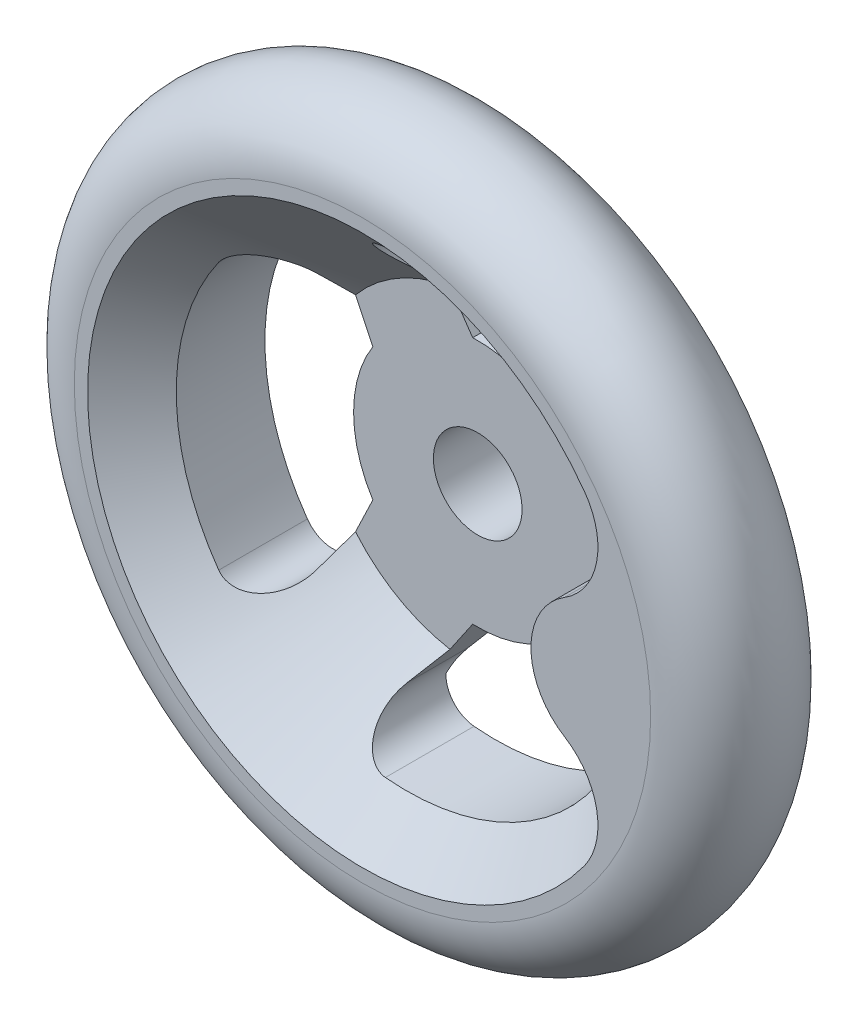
ISO-10303-21;
HEADER;
FILE_DESCRIPTION(('STEP AP214'),'2;1');
FILE_NAME('part.step','',(''),(''),'','','');
FILE_SCHEMA(('AUTOMOTIVE_DESIGN { 1 0 10303 214 1 1 1 1 }'));
ENDSEC;
DATA;
#1=APPLICATION_CONTEXT('core data for automotive mechanical design processes');
#2=APPLICATION_PROTOCOL_DEFINITION('international standard','automotive_design',2000,#1);
#3=PRODUCT_CONTEXT('',#1,'mechanical');
#4=PRODUCT('Part','Part','',(#3));
#5=PRODUCT_RELATED_PRODUCT_CATEGORY('part','',(#4));
#6=PRODUCT_DEFINITION_FORMATION('','',#4);
#7=PRODUCT_DEFINITION_CONTEXT('part definition',#1,'design');
#8=PRODUCT_DEFINITION('design','',#6,#7);
#9=PRODUCT_DEFINITION_SHAPE('','',#8);
#10=(LENGTH_UNIT() NAMED_UNIT(*) SI_UNIT(.MILLI.,.METRE.));
#11=(NAMED_UNIT(*) PLANE_ANGLE_UNIT() SI_UNIT($,.RADIAN.));
#12=(NAMED_UNIT(*) SI_UNIT($,.STERADIAN.) SOLID_ANGLE_UNIT());
#13=UNCERTAINTY_MEASURE_WITH_UNIT(LENGTH_MEASURE(1.E-05),#10,'distance_accuracy_value','');
#14=(GEOMETRIC_REPRESENTATION_CONTEXT(3) GLOBAL_UNCERTAINTY_ASSIGNED_CONTEXT((#13)) GLOBAL_UNIT_ASSIGNED_CONTEXT((#10,
#11,#12)) REPRESENTATION_CONTEXT('',''));
#15=CARTESIAN_POINT('',(0.,0.,0.));
#16=DIRECTION('',(0.,0.,1.));
#17=DIRECTION('',(1.,0.,0.));
#18=AXIS2_PLACEMENT_3D('',#15,#16,#17);
#19=CARTESIAN_POINT('',(12.292893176,0.,3.292893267));
#20=CARTESIAN_POINT('',(12.292893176,-24.585786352,3.292893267));
#21=CARTESIAN_POINT('',(-12.292893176,-24.585786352,3.292893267));
#22=CARTESIAN_POINT('',(-12.292893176,0.,3.292893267));
#23=CARTESIAN_POINT('',(12.10285038,0.,3.10285047));
#24=CARTESIAN_POINT('',(12.10285038,-24.20570076,3.10285047));
#25=CARTESIAN_POINT('',(-12.10285038,-24.20570076,3.10285047));
#26=CARTESIAN_POINT('',(-12.10285038,0.,3.10285047));
#27=CARTESIAN_POINT('',(11.99999996,0.,2.85454759));
#28=CARTESIAN_POINT('',(11.99999996,-23.99999992,2.85454759));
#29=CARTESIAN_POINT('',(-11.99999996,-23.99999992,2.85454759));
#30=CARTESIAN_POINT('',(-11.99999996,0.,2.85454759));
#31=CARTESIAN_POINT('',(11.99999996,0.,2.585786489));
#32=CARTESIAN_POINT('',(11.99999996,-23.99999992,2.585786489));
#33=CARTESIAN_POINT('',(-11.99999996,-23.99999992,2.585786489));
#34=CARTESIAN_POINT('',(-11.99999996,0.,2.585786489));
#35=(BOUNDED_SURFACE() B_SPLINE_SURFACE(3,3,((#19,#20,#21,#22),(#23,#24,#25,#26),(#27,#28,#29,
#30),(#31,#32,#33,#34)),.UNSPECIFIED.,.F.,.F.,.F.) B_SPLINE_SURFACE_WITH_KNOTS((4,4),(4,4),(0.,
1.),(0.,1.),.UNSPECIFIED.) GEOMETRIC_REPRESENTATION_ITEM() RATIONAL_B_SPLINE_SURFACE(((1.,
0.333333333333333,0.333333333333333,1.),(0.949253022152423,0.316417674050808,0.316417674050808,
0.949253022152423),(0.949253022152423,0.316417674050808,0.316417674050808,0.949253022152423),
(1.,0.333333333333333,0.333333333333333,1.))) REPRESENTATION_ITEM('') SURFACE());
#36=CARTESIAN_POINT('',(12.292893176,0.,3.292893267));
#37=CARTESIAN_POINT('',(12.10285038,0.,3.10285047));
#38=CARTESIAN_POINT('',(11.99999996,0.,2.85454759));
#39=CARTESIAN_POINT('',(11.99999996,0.,2.585786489));
#40=(BOUNDED_CURVE() B_SPLINE_CURVE(3,(#36,#37,#38,#39),.UNSPECIFIED.,.F.,
.F.) B_SPLINE_CURVE_WITH_KNOTS((4,4),(0.,1.),
.UNSPECIFIED.) CURVE() GEOMETRIC_REPRESENTATION_ITEM() RATIONAL_B_SPLINE_CURVE((1.,
0.949253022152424,0.949253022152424,1.)) REPRESENTATION_ITEM(''));
#41=CARTESIAN_POINT('',(11.99999996,-2.4612410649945E-09,2.585786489));
#42=VERTEX_POINT('',#41);
#43=CARTESIAN_POINT('',(12.292893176,0.,3.292893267));
#44=VERTEX_POINT('',#43);
#45=EDGE_CURVE('E485',#42,#44,#40,.F.);
#46=CARTESIAN_POINT('',(0.,0.,3.292893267));
#47=DIRECTION('',(0.,0.,1.));
#48=DIRECTION('',(1.,0.,0.));
#49=AXIS2_PLACEMENT_3D('',#46,#47,#48);
#50=CIRCLE('',#49,12.292893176);
#51=CARTESIAN_POINT('',(-12.292893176,-3.78197171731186E-09,3.292893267));
#52=VERTEX_POINT('',#51);
#53=EDGE_CURVE('E239',#52,#44,#50,.T.);
#54=CARTESIAN_POINT('',(-12.292893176,0.,3.292893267));
#55=CARTESIAN_POINT('',(-12.10285038,0.,3.10285047));
#56=CARTESIAN_POINT('',(-11.99999996,0.,2.85454759));
#57=CARTESIAN_POINT('',(-11.99999996,0.,2.585786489));
#58=(BOUNDED_CURVE() B_SPLINE_CURVE(3,(#54,#55,#56,#57),.UNSPECIFIED.,.F.,
.F.) B_SPLINE_CURVE_WITH_KNOTS((4,4),(0.,1.),
.UNSPECIFIED.) CURVE() GEOMETRIC_REPRESENTATION_ITEM() RATIONAL_B_SPLINE_CURVE((1.,
0.949253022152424,0.949253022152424,1.)) REPRESENTATION_ITEM(''));
#59=CARTESIAN_POINT('',(-11.99999996,-5.3876169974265E-10,2.585786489));
#60=VERTEX_POINT('',#59);
#61=EDGE_CURVE('E479',#52,#60,#58,.T.);
#62=CARTESIAN_POINT('',(0.,0.,2.585786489));
#63=DIRECTION('',(0.,0.,-1.));
#64=DIRECTION('',(-1.,0.,0.));
#65=AXIS2_PLACEMENT_3D('',#62,#63,#64);
#66=CIRCLE('',#65,11.99999996);
#67=EDGE_CURVE('E477',#42,#60,#66,.T.);
#68=ORIENTED_EDGE('',*,*,#45,.T.);
#69=ORIENTED_EDGE('',*,*,#53,.F.);
#70=ORIENTED_EDGE('',*,*,#61,.T.);
#71=ORIENTED_EDGE('',*,*,#67,.F.);
#72=EDGE_LOOP('',(#68,#69,#70,#71));
#73=FACE_BOUND('',#72,.T.);
#74=ADVANCED_FACE('F14',(#73),#35,.F.);
#75=CARTESIAN_POINT('',(0.,0.,2.585786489));
#76=DIRECTION('',(0.,0.,-1.));
#77=DIRECTION('',(0.,1.,0.));
#78=AXIS2_PLACEMENT_3D('',#75,#76,#77);
#79=CYLINDRICAL_SURFACE('',#78,11.99999996);
#80=CARTESIAN_POINT('',(0.,0.,0.));
#81=DIRECTION('',(0.,0.,-1.));
#82=DIRECTION('',(0.,1.,0.));
#83=AXIS2_PLACEMENT_3D('',#80,#81,#82);
#84=CIRCLE('',#83,11.99999996);
#85=CARTESIAN_POINT('',(0.,11.99999996,0.));
#86=VERTEX_POINT('',#85);
#87=EDGE_CURVE('E511',#86,#86,#84,.F.);
#88=ORIENTED_EDGE('',*,*,#87,.T.);
#89=EDGE_LOOP('',(#88));
#90=FACE_BOUND('',#89,.T.);
#91=CARTESIAN_POINT('',(0.,0.,2.585786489));
#92=DIRECTION('',(0.,0.,-1.));
#93=DIRECTION('',(0.,1.,0.));
#94=AXIS2_PLACEMENT_3D('',#91,#92,#93);
#95=CIRCLE('',#94,11.99999996);
#96=EDGE_CURVE('E482',#60,#42,#95,.T.);
#97=ORIENTED_EDGE('',*,*,#96,.T.);
#98=ORIENTED_EDGE('',*,*,#67,.T.);
#99=EDGE_LOOP('',(#97,#98));
#100=FACE_BOUND('',#99,.T.);
#101=ADVANCED_FACE('F816',(#90,#100),#79,.T.);
#102=CARTESIAN_POINT('',(-12.292893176,0.,3.292893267));
#103=CARTESIAN_POINT('',(-12.292893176,24.585786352,3.292893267));
#104=CARTESIAN_POINT('',(12.292893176,24.585786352,3.292893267));
#105=CARTESIAN_POINT('',(12.292893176,0.,3.292893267));
#106=CARTESIAN_POINT('',(-12.10285038,0.,3.10285047));
#107=CARTESIAN_POINT('',(-12.10285038,24.20570076,3.10285047));
#108=CARTESIAN_POINT('',(12.10285038,24.20570076,3.10285047));
#109=CARTESIAN_POINT('',(12.10285038,0.,3.10285047));
#110=CARTESIAN_POINT('',(-11.99999996,0.,2.85454759));
#111=CARTESIAN_POINT('',(-11.99999996,23.99999992,2.85454759));
#112=CARTESIAN_POINT('',(11.99999996,23.99999992,2.85454759));
#113=CARTESIAN_POINT('',(11.99999996,0.,2.85454759));
#114=CARTESIAN_POINT('',(-11.99999996,0.,2.585786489));
#115=CARTESIAN_POINT('',(-11.99999996,23.99999992,2.585786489));
#116=CARTESIAN_POINT('',(11.99999996,23.99999992,2.585786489));
#117=CARTESIAN_POINT('',(11.99999996,0.,2.585786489));
#118=(BOUNDED_SURFACE() B_SPLINE_SURFACE(3,3,((#102,#103,#104,#105),(#106,#107,#108,#109),(#110,
#111,#112,#113),(#114,#115,#116,#117)),.UNSPECIFIED.,.F.,.F.,
.F.) B_SPLINE_SURFACE_WITH_KNOTS((4,4),(4,4),(0.,1.),(0.,1.),
.UNSPECIFIED.) GEOMETRIC_REPRESENTATION_ITEM() RATIONAL_B_SPLINE_SURFACE(((1.,0.333333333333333,
0.333333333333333,1.),(0.949253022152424,0.316417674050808,0.316417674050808,0.949253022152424),
(0.949253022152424,0.316417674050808,0.316417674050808,0.949253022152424),(1.,0.333333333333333,
0.333333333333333,1.))) REPRESENTATION_ITEM('') SURFACE());
#119=CARTESIAN_POINT('',(0.,0.,3.292893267));
#120=DIRECTION('',(0.,0.,1.));
#121=DIRECTION('',(1.,0.,0.));
#122=AXIS2_PLACEMENT_3D('',#119,#120,#121);
#123=CIRCLE('',#122,12.292893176);
#124=EDGE_CURVE('E507',#44,#52,#123,.T.);
#125=ORIENTED_EDGE('',*,*,#96,.F.);
#126=ORIENTED_EDGE('',*,*,#61,.F.);
#127=ORIENTED_EDGE('',*,*,#124,.F.);
#128=ORIENTED_EDGE('',*,*,#45,.F.);
#129=EDGE_LOOP('',(#125,#126,#127,#128));
#130=FACE_BOUND('',#129,.T.);
#131=ADVANCED_FACE('F837',(#130),#118,.F.);
#132=CARTESIAN_POINT('',(0.,0.,21.500000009));
#133=DIRECTION('',(0.,0.,-1.));
#134=DIRECTION('',(0.,1.,0.));
#135=AXIS2_PLACEMENT_3D('',#132,#133,#134);
#136=TOROIDAL_SURFACE('',#135,32.5,7.5);
#137=CARTESIAN_POINT('',(0.,0.,14.000000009));
#138=DIRECTION('',(0.,0.,-1.));
#139=DIRECTION('',(0.,1.,0.));
#140=AXIS2_PLACEMENT_3D('',#137,#138,#139);
#141=CIRCLE('',#140,32.49999998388);
#142=CARTESIAN_POINT('',(0.,32.49999998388,14.000000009));
#143=VERTEX_POINT('',#142);
#144=EDGE_CURVE('E539',#143,#143,#141,.F.);
#145=ORIENTED_EDGE('',*,*,#144,.T.);
#146=EDGE_LOOP('',(#145));
#147=FACE_BOUND('',#146,.T.);
#148=CARTESIAN_POINT('',(0.,0.,29.000000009));
#149=DIRECTION('',(0.,0.,-1.));
#150=DIRECTION('',(0.,1.,0.));
#151=AXIS2_PLACEMENT_3D('',#148,#149,#150);
#152=CIRCLE('',#151,32.49999998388);
#153=CARTESIAN_POINT('',(0.,32.49999998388,29.000000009));
#154=VERTEX_POINT('',#153);
#155=EDGE_CURVE('E534',#154,#154,#152,.T.);
#156=ORIENTED_EDGE('',*,*,#155,.T.);
#157=EDGE_LOOP('',(#156));
#158=FACE_BOUND('',#157,.T.);
#159=ADVANCED_FACE('F456',(#147,#158),#136,.T.);
#160=CARTESIAN_POINT('',(0.,0.,14.000000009));
#161=DIRECTION('',(0.,0.,1.));
#162=DIRECTION('',(0.,-1.,0.));
#163=AXIS2_PLACEMENT_3D('',#160,#161,#162);
#164=CYLINDRICAL_SURFACE('',#163,26.);
#165=CARTESIAN_POINT('',(0.,0.,24.0000000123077));
#166=DIRECTION('',(0.,0.,1.));
#167=DIRECTION('',(1.,0.,0.));
#168=AXIS2_PLACEMENT_3D('',#165,#166,#167);
#169=CIRCLE('',#168,26.0000000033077);
#170=CARTESIAN_POINT('',(23.6265645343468,10.8529004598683,24.0000000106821));
#171=VERTEX_POINT('',#170);
#172=CARTESIAN_POINT('',(-2.41439476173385,25.8876553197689,24.0000000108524));
#173=VERTEX_POINT('',#172);
#174=EDGE_CURVE('E541',#171,#173,#169,.T.);
#175=ORIENTED_EDGE('',*,*,#174,.T.);
#176=DIRECTION('',(0.,0.,-1.));
#177=VECTOR('',#176,1.);
#178=CARTESIAN_POINT('',(-2.41439476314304,25.8876553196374,18.0116940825));
#179=LINE('',#178,#177);
#180=CARTESIAN_POINT('',(-2.41439476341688,25.8876553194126,14.0000000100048));
#181=VERTEX_POINT('',#180);
#182=EDGE_CURVE('E504',#173,#181,#179,.T.);
#183=ORIENTED_EDGE('',*,*,#182,.T.);
#184=CARTESIAN_POINT('',(0.,0.,14.000000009));
#185=DIRECTION('',(0.,0.,1.));
#186=DIRECTION('',(0.,-1.,0.));
#187=AXIS2_PLACEMENT_3D('',#184,#185,#186);
#188=CIRCLE('',#187,26.);
#189=CARTESIAN_POINT('',(23.6265645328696,10.8529004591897,14.000000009));
#190=VERTEX_POINT('',#189);
#191=EDGE_CURVE('E724',#181,#190,#188,.F.);
#192=ORIENTED_EDGE('',*,*,#191,.T.);
#193=DIRECTION('',(0.,0.,1.));
#194=VECTOR('',#193,1.);
#195=CARTESIAN_POINT('',(23.6265645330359,10.8529004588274,19.030000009));
#196=LINE('',#195,#194);
#197=EDGE_CURVE('E524',#190,#171,#196,.T.);
#198=ORIENTED_EDGE('',*,*,#197,.T.);
#199=EDGE_LOOP('',(#175,#183,#192,#198));
#200=FACE_BOUND('',#199,.T.);
#201=ADVANCED_FACE('F780',(#200),#164,.F.);
#202=CARTESIAN_POINT('',(-2.089380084,22.402778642,11.951528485));
#203=DIRECTION('',(0.,0.,1.));
#204=DIRECTION('',(0.,-1.,0.));
#205=AXIS2_PLACEMENT_3D('',#202,#203,#204);
#206=CYLINDRICAL_SURFACE('',#205,3.5);
#207=CARTESIAN_POINT('',(-2.41439476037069,25.8876553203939,24.0000000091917));
#208=CARTESIAN_POINT('',(-2.49531943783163,25.8801261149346,24.0000142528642));
#209=CARTESIAN_POINT('',(-2.5759659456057,25.8697438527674,23.9975506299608));
#210=CARTESIAN_POINT('',(-2.73601371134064,25.8434768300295,23.9877773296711));
#211=CARTESIAN_POINT('',(-2.81541566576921,25.8275952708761,23.9804704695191));
#212=CARTESIAN_POINT('',(-2.97183811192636,25.7906522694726,23.9611870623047));
#213=CARTESIAN_POINT('',(-3.04887127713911,25.7696274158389,23.9492431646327));
#214=CARTESIAN_POINT('',(-3.20056206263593,25.7226564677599,23.9208900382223));
#215=CARTESIAN_POINT('',(-3.27521944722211,25.6967098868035,23.9044803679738));
#216=CARTESIAN_POINT('',(-3.49458678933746,25.6121166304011,23.8489762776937));
#217=CARTESIAN_POINT('',(-3.63515165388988,25.5466053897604,23.8035482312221));
#218=CARTESIAN_POINT('',(-3.90235624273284,25.4005163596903,23.6981336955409));
#219=CARTESIAN_POINT('',(-4.02897048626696,25.3199117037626,23.6381211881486));
#220=CARTESIAN_POINT('',(-4.30617778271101,25.1182978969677,23.4841421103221));
#221=CARTESIAN_POINT('',(-4.45087813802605,24.9927368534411,23.3855077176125));
#222=CARTESIAN_POINT('',(-4.71252626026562,24.7274233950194,23.1720072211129));
#223=CARTESIAN_POINT('',(-4.82943128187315,24.5876495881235,23.0571165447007));
#224=CARTESIAN_POINT('',(-5.0701394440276,24.2522170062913,22.7759270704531));
#225=CARTESIAN_POINT('',(-5.18383377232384,24.0531605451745,22.6050568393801));
#226=CARTESIAN_POINT('',(-5.36801006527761,23.6478768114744,22.2491177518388));
#227=CARTESIAN_POINT('',(-5.43842610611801,23.4416391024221,22.0640277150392));
#228=CARTESIAN_POINT('',(-5.52151636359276,23.1021340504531,21.7527253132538));
#229=CARTESIAN_POINT('',(-5.54583505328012,22.9691522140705,21.6291335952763));
#230=CARTESIAN_POINT('',(-5.57897139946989,22.7038386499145,21.3791998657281));
#231=CARTESIAN_POINT('',(-5.58778470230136,22.5715071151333,21.2528570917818));
#232=CARTESIAN_POINT('',(-5.59197856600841,22.1768454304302,20.870896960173));
#233=CARTESIAN_POINT('',(-5.56513277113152,21.916762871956,20.612269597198));
#234=CARTESIAN_POINT('',(-5.48674655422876,21.5539622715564,20.2413538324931));
#235=CARTESIAN_POINT('',(-5.45781915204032,21.4455836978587,20.1291852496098));
#236=CARTESIAN_POINT('',(-5.3895823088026,21.2317763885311,19.9051557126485));
#237=CARTESIAN_POINT('',(-5.35027472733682,21.1263471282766,19.793294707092));
#238=CARTESIAN_POINT('',(-5.2614521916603,20.9193299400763,19.5708345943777));
#239=CARTESIAN_POINT('',(-5.21197188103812,20.8177303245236,19.4602325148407));
#240=CARTESIAN_POINT('',(-5.10257609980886,20.6185380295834,19.2405196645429));
#241=CARTESIAN_POINT('',(-5.04265702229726,20.5209467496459,19.1314094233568));
#242=CARTESIAN_POINT('',(-4.97746161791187,20.4256633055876,19.0233880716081));
#243=B_SPLINE_CURVE_WITH_KNOTS('',3,(#207,#208,#209,#210,#211,#212,#213,#214,#215,#216,#217,
#218,#219,#220,#221,#222,#223,#224,#225,#226,#227,#228,#229,#230,#231,#232,#233,#234,#235,#236,
#237,#238,#239,#240,#241,#242),.UNSPECIFIED.,.F.,.F.,(4,2,2,2,2,2,2,2,2,2,2,2,2,2,2,2,2,4),(0.,
0.24371557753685,0.487289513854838,0.729178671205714,0.971091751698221,1.45350707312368,
1.93678940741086,2.57969605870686,3.22358510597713,4.07676239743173,4.9312360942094,
5.48007557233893,6.02906913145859,7.12670817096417,7.6023733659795,8.07795340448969,
8.55193989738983,9.0260904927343),.UNSPECIFIED.);
#244=CARTESIAN_POINT('',(-4.97746161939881,20.4256633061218,19.0233880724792));
#245=VERTEX_POINT('',#244);
#246=EDGE_CURVE('E264',#173,#245,#243,.T.);
#247=ORIENTED_EDGE('',*,*,#246,.T.);
#248=DIRECTION('',(0.,0.,-1.));
#249=VECTOR('',#248,1.);
#250=CARTESIAN_POINT('',(-4.97746162,20.425663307,12.011694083));
#251=LINE('',#250,#249);
#252=CARTESIAN_POINT('',(-4.97746162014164,20.4256633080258,12.0233881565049));
#253=VERTEX_POINT('',#252);
#254=EDGE_CURVE('E572',#245,#253,#251,.T.);
#255=ORIENTED_EDGE('',*,*,#254,.T.);
#256=CARTESIAN_POINT('',(-5.58817161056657,22.3108120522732,14.0000000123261));
#257=CARTESIAN_POINT('',(-5.58443372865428,22.1701425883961,13.8626564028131));
#258=CARTESIAN_POINT('',(-5.5723168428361,22.0306100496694,13.7244038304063));
#259=CARTESIAN_POINT('',(-5.53168914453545,21.7546676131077,13.4469311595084));
#260=CARTESIAN_POINT('',(-5.5031631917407,21.6182607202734,13.307710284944));
#261=CARTESIAN_POINT('',(-5.4307260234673,21.3520205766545,13.0318321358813));
#262=CARTESIAN_POINT('',(-5.38709138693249,21.2221142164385,12.8951724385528));
#263=CARTESIAN_POINT('',(-5.28445226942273,20.9673844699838,12.6230497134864));
#264=CARTESIAN_POINT('',(-5.2254603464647,20.8425570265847,12.4875858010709));
#265=CARTESIAN_POINT('',(-5.1312235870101,20.6705951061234,12.2979520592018));
#266=CARTESIAN_POINT('',(-5.10241065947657,20.6209341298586,12.2428155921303));
#267=CARTESIAN_POINT('',(-5.04201167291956,20.5225370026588,12.1328205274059));
#268=CARTESIAN_POINT('',(-5.01041594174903,20.4738048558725,12.0779636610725));
#269=CARTESIAN_POINT('',(-4.97746161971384,20.4256633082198,12.0233881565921));
#270=B_SPLINE_CURVE_WITH_KNOTS('',3,(#256,#257,#258,#259,#260,#261,#262,#263,#264,#265,#266,
#267,#268,#269),.UNSPECIFIED.,.F.,.F.,(4,2,2,2,2,2,4),(0.,0.589696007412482,1.17993699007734,
1.75989917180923,2.33938858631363,2.57814975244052,2.81777625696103),.UNSPECIFIED.);
#271=CARTESIAN_POINT('',(-5.5881716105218,22.31081205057,14.0000000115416));
#272=VERTEX_POINT('',#271);
#273=EDGE_CURVE('E535',#272,#253,#270,.T.);
#274=ORIENTED_EDGE('',*,*,#273,.F.);
#275=CARTESIAN_POINT('',(-2.089380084,22.402778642,14.0000000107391));
#276=DIRECTION('',(0.,0.,1.));
#277=DIRECTION('',(0.,-1.,0.));
#278=AXIS2_PLACEMENT_3D('',#275,#276,#277);
#279=CIRCLE('',#278,3.5);
#280=EDGE_CURVE('E725',#272,#181,#279,.F.);
#281=ORIENTED_EDGE('',*,*,#280,.T.);
#282=ORIENTED_EDGE('',*,*,#182,.F.);
#283=EDGE_LOOP('',(#247,#255,#274,#281,#282));
#284=FACE_BOUND('',#283,.T.);
#285=ADVANCED_FACE('F775',(#284),#206,.F.);
#286=CARTESIAN_POINT('',(-18.356685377,13.010845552,11.951528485));
#287=DIRECTION('',(0.,0.,1.));
#288=DIRECTION('',(0.,-1.,0.));
#289=AXIS2_PLACEMENT_3D('',#286,#287,#288);
#290=CYLINDRICAL_SURFACE('',#289,3.5);
#291=DIRECTION('',(0.,0.,1.));
#292=VECTOR('',#291,1.);
#293=CARTESIAN_POINT('',(-15.200412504,14.523439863,12.011694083));
#294=LINE('',#293,#292);
#295=CARTESIAN_POINT('',(-15.2004125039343,14.5234398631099,12.0233881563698));
#296=VERTEX_POINT('',#295);
#297=CARTESIAN_POINT('',(-15.2004125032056,14.5234398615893,19.0233880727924));
#298=VERTEX_POINT('',#297);
#299=EDGE_CURVE('E404',#296,#298,#294,.T.);
#300=ORIENTED_EDGE('',*,*,#299,.T.);
#301=CARTESIAN_POINT('',(-15.2004125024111,14.5234398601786,19.0233880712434));
#302=CARTESIAN_POINT('',(-15.230400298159,14.5860056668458,19.088293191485));
#303=CARTESIAN_POINT('',(-15.2620713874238,14.6473280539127,19.1535965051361));
#304=CARTESIAN_POINT('',(-15.3286447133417,14.7674589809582,19.2848484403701));
#305=CARTESIAN_POINT('',(-15.3635465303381,14.8262678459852,19.350796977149));
#306=CARTESIAN_POINT('',(-15.4728755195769,14.9988573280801,19.5493515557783));
#307=CARTESIAN_POINT('',(-15.5519526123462,15.1088554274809,19.6827234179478));
#308=CARTESIAN_POINT('',(-15.7221486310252,15.3190072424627,19.951256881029));
#309=CARTESIAN_POINT('',(-15.8133417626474,15.4190930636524,20.0864244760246));
#310=CARTESIAN_POINT('',(-16.0066206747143,15.6080505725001,20.3567263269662));
#311=CARTESIAN_POINT('',(-16.108707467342,15.6969212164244,20.491860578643));
#312=CARTESIAN_POINT('',(-16.431819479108,15.946705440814,20.8976126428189));
#313=CARTESIAN_POINT('',(-16.6688288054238,16.0897193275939,21.1672105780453));
#314=CARTESIAN_POINT('',(-17.0515972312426,16.2614220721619,21.5624459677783));
#315=CARTESIAN_POINT('',(-17.1836256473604,16.3114995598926,21.6925749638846));
#316=CARTESIAN_POINT('',(-17.4562541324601,16.3960449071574,21.9488433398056));
#317=CARTESIAN_POINT('',(-17.5968500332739,16.430520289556,22.0749846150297));
#318=CARTESIAN_POINT('',(-17.9342896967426,16.4907914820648,22.3633671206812));
#319=CARTESIAN_POINT('',(-18.134193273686,16.5098065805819,22.5235394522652));
#320=CARTESIAN_POINT('',(-18.5446222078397,16.5117992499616,22.8298997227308));
#321=CARTESIAN_POINT('',(-18.7551323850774,16.4948269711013,22.9761068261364));
#322=CARTESIAN_POINT('',(-19.1348181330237,16.4274373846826,23.2187380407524));
#323=CARTESIAN_POINT('',(-19.3029361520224,16.3851694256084,23.3190485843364));
#324=CARTESIAN_POINT('',(-19.6385711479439,16.2724396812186,23.5037851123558));
#325=CARTESIAN_POINT('',(-19.8060885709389,16.2020075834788,23.5882276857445));
#326=CARTESIAN_POINT('',(-20.1060917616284,16.0461316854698,23.7237957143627));
#327=CARTESIAN_POINT('',(-20.2395834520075,15.9654624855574,23.7781647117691));
#328=CARTESIAN_POINT('',(-20.4980560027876,15.783816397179,23.8703781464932));
#329=CARTESIAN_POINT('',(-20.6230519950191,15.6828769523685,23.908252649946));
#330=CARTESIAN_POINT('',(-20.8279089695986,15.4921766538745,23.9575770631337));
#331=CARTESIAN_POINT('',(-20.9108202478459,15.406802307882,23.9734068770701));
#332=CARTESIAN_POINT('',(-21.0288175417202,15.2721044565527,23.989320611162));
#333=CARTESIAN_POINT('',(-21.0671393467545,15.2260273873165,23.9933201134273));
#334=CARTESIAN_POINT('',(-21.1414508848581,15.131855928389,23.9986616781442));
#335=CARTESIAN_POINT('',(-21.1774397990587,15.083760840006,24.000002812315));
#336=CARTESIAN_POINT('',(-21.2121697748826,15.0347548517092,24.0000000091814));
#337=B_SPLINE_CURVE_WITH_KNOTS('',3,(#301,#302,#303,#304,#305,#306,#307,#308,#309,#310,#311,
#312,#313,#314,#315,#316,#317,#318,#319,#320,#321,#322,#323,#324,#325,#326,#327,#328,#329,#330,
#331,#332,#333,#334,#335,#336),.UNSPECIFIED.,.F.,.F.,(4,2,2,2,2,2,2,2,2,2,2,2,2,2,2,2,2,4),(0.,
0.284970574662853,0.569904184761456,1.13952288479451,1.71280661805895,2.28614366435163,
3.43858375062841,4.01398669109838,4.58911189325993,5.35697741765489,6.1237735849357,
6.72243733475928,7.32047169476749,7.81399229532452,8.3066095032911,8.6656956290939,
8.8457622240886,9.02589168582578),.UNSPECIFIED.);
#338=CARTESIAN_POINT('',(-21.2121697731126,15.0347548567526,24.0000000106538));
#339=VERTEX_POINT('',#338);
#340=EDGE_CURVE('E372',#298,#339,#337,.T.);
#341=ORIENTED_EDGE('',*,*,#340,.T.);
#342=DIRECTION('',(0.,0.,-1.));
#343=VECTOR('',#342,1.);
#344=CARTESIAN_POINT('',(-21.2121697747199,15.0347548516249,19.000000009));
#345=LINE('',#344,#343);
#346=CARTESIAN_POINT('',(-21.2121697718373,15.0347548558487,14.0000000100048));
#347=VERTEX_POINT('',#346);
#348=EDGE_CURVE('E517',#339,#347,#345,.T.);
#349=ORIENTED_EDGE('',*,*,#348,.T.);
#350=CARTESIAN_POINT('',(-18.356685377,13.010845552,14.0000000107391));
#351=DIRECTION('',(0.,0.,1.));
#352=DIRECTION('',(0.,-1.,0.));
#353=AXIS2_PLACEMENT_3D('',#350,#351,#352);
#354=CIRCLE('',#353,3.5);
#355=CARTESIAN_POINT('',(-16.5276442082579,15.9949046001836,14.0000000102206));
#356=VERTEX_POINT('',#355);
#357=EDGE_CURVE('E732',#347,#356,#354,.F.);
#358=ORIENTED_EDGE('',*,*,#357,.T.);
#359=CARTESIAN_POINT('',(-15.2004125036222,14.5234398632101,12.0233881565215));
#360=CARTESIAN_POINT('',(-15.2307387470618,14.5867108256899,12.0890251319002));
#361=CARTESIAN_POINT('',(-15.2627853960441,14.6487094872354,12.1550681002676));
#362=CARTESIAN_POINT('',(-15.3301827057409,14.7701379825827,12.2878146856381));
#363=CARTESIAN_POINT('',(-15.3655330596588,14.8295680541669,12.3545182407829));
#364=CARTESIAN_POINT('',(-15.4763542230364,15.0040032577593,12.55543074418));
#365=CARTESIAN_POINT('',(-15.5565862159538,15.1151349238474,12.6904223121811));
#366=CARTESIAN_POINT('',(-15.7273621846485,15.3248565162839,12.9590739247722));
#367=CARTESIAN_POINT('',(-15.8177141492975,15.4236231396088,13.0927191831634));
#368=CARTESIAN_POINT('',(-16.0090595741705,15.6101702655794,13.359950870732));
#369=CARTESIAN_POINT('',(-16.1100468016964,15.6979571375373,13.4935372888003));
#370=CARTESIAN_POINT('',(-16.2657053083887,15.8182893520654,13.6890151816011));
#371=CARTESIAN_POINT('',(-16.3164598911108,15.8553930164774,13.7512690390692));
#372=CARTESIAN_POINT('',(-16.4203303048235,15.9270972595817,13.8757420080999));
#373=CARTESIAN_POINT('',(-16.4734546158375,15.9616874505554,13.9379600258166));
#374=CARTESIAN_POINT('',(-16.5276442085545,15.9949046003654,14.0000000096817));
#375=B_SPLINE_CURVE_WITH_KNOTS('',3,(#359,#360,#361,#362,#363,#364,#365,#366,#367,#368,#369,
#370,#371,#372,#373,#374),.UNSPECIFIED.,.F.,.F.,(4,2,2,2,2,2,2,4),(0.,0.288179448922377,
0.576332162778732,1.15272159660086,1.71959970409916,2.28614742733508,2.55152386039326,
2.81794108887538),.UNSPECIFIED.);
#376=EDGE_CURVE('E510',#296,#356,#375,.T.);
#377=ORIENTED_EDGE('',*,*,#376,.F.);
#378=EDGE_LOOP('',(#300,#341,#349,#358,#377));
#379=FACE_BOUND('',#378,.T.);
#380=ADVANCED_FACE('F779',(#379),#290,.F.);
#381=CARTESIAN_POINT('',(0.,0.,14.000000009));
#382=DIRECTION('',(0.,0.,1.));
#383=DIRECTION('',(0.,-1.,0.));
#384=AXIS2_PLACEMENT_3D('',#381,#382,#383);
#385=CYLINDRICAL_SURFACE('',#384,26.);
#386=CARTESIAN_POINT('',(0.,0.,24.0000000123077));
#387=DIRECTION('',(0.,0.,1.));
#388=DIRECTION('',(1.,0.,0.));
#389=AXIS2_PLACEMENT_3D('',#386,#387,#388);
#390=CIRCLE('',#389,26.0000000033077);
#391=CARTESIAN_POINT('',(-21.2121697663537,-15.0347548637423,24.0000000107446));
#392=VERTEX_POINT('',#391);
#393=EDGE_CURVE('E520',#339,#392,#390,.T.);
#394=ORIENTED_EDGE('',*,*,#393,.T.);
#395=DIRECTION('',(0.,0.,-1.));
#396=VECTOR('',#395,1.);
#397=CARTESIAN_POINT('',(-21.2121697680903,-15.0347548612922,18.0116940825));
#398=LINE('',#397,#396);
#399=CARTESIAN_POINT('',(-21.2121697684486,-15.0347548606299,14.0000000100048));
#400=VERTEX_POINT('',#399);
#401=EDGE_CURVE('E514',#392,#400,#398,.T.);
#402=ORIENTED_EDGE('',*,*,#401,.T.);
#403=CARTESIAN_POINT('',(0.,0.,14.000000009));
#404=DIRECTION('',(0.,0.,1.));
#405=DIRECTION('',(0.,-1.,0.));
#406=AXIS2_PLACEMENT_3D('',#403,#404,#405);
#407=CIRCLE('',#406,26.);
#408=EDGE_CURVE('E735',#400,#347,#407,.F.);
#409=ORIENTED_EDGE('',*,*,#408,.T.);
#410=ORIENTED_EDGE('',*,*,#348,.F.);
#411=EDGE_LOOP('',(#394,#402,#409,#410));
#412=FACE_BOUND('',#411,.T.);
#413=ADVANCED_FACE('F787',(#412),#385,.F.);
#414=CARTESIAN_POINT('',(-2.089380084,-22.402778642,11.951528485));
#415=DIRECTION('',(0.,0.,1.));
#416=DIRECTION('',(0.,-1.,0.));
#417=AXIS2_PLACEMENT_3D('',#414,#415,#416);
#418=CYLINDRICAL_SURFACE('',#417,3.5);
#419=DIRECTION('',(0.,0.,1.));
#420=VECTOR('',#419,1.);
#421=CARTESIAN_POINT('',(-4.97746162,-20.425663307,12.011694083));
#422=LINE('',#421,#420);
#423=CARTESIAN_POINT('',(-4.97746161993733,-20.4256633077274,12.0233881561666));
#424=VERTEX_POINT('',#423);
#425=CARTESIAN_POINT('',(-4.97746161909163,-20.425663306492,19.0233880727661));
#426=VERTEX_POINT('',#425);
#427=EDGE_CURVE('E230',#424,#426,#422,.T.);
#428=ORIENTED_EDGE('',*,*,#427,.T.);
#429=CARTESIAN_POINT('',(-4.97746161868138,-20.4256633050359,19.023388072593));
#430=CARTESIAN_POINT('',(-5.0166512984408,-20.482916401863,19.0882931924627));
#431=CARTESIAN_POINT('',(-5.05392249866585,-20.5410055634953,19.1535965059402));
#432=CARTESIAN_POINT('',(-5.12467227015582,-20.658725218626,19.2848484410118));
#433=CARTESIAN_POINT('',(-5.15815133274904,-20.7183555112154,19.350796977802));
#434=CARTESIAN_POINT('',(-5.25295371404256,-20.8993319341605,19.5493515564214));
#435=CARTESIAN_POINT('',(-5.30867631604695,-21.0228137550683,19.6827234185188));
#436=CARTESIAN_POINT('',(-5.40557511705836,-21.2752837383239,19.9512568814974));
#437=CARTESIAN_POINT('',(-5.4466554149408,-21.4043022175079,20.0864244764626));
#438=CARTESIAN_POINT('',(-5.5136579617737,-21.6661654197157,20.3567263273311));
#439=CARTESIAN_POINT('',(-5.53957880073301,-21.7990104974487,20.491860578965));
#440=CARTESIAN_POINT('',(-5.59434227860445,-22.2037258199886,20.8976126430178));
#441=CARTESIAN_POINT('',(-5.59969127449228,-22.4804888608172,21.1672105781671));
#442=CARTESIAN_POINT('',(-5.55700600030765,-22.8978274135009,21.5624459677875));
#443=CARTESIAN_POINT('',(-5.53436016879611,-23.0372061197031,21.6925749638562));
#444=CARTESIAN_POINT('',(-5.471264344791,-23.3155819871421,21.9488433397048));
#445=CARTESIAN_POINT('',(-5.43082295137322,-23.4545793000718,22.0749846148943));
#446=CARTESIAN_POINT('',(-5.31429950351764,-23.7769462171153,22.3633671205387));
#447=CARTESIAN_POINT('',(-5.23081527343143,-23.959575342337,22.5235394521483));
#448=CARTESIAN_POINT('',(-5.02732650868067,-24.3160135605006,22.8298997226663));
#449=CARTESIAN_POINT('',(-4.90737299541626,-24.4898345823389,22.9761068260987));
#450=CARTESIAN_POINT('',(-4.65916902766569,-24.7849572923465,23.2187380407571));
#451=CARTESIAN_POINT('',(-4.53850489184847,-24.9094177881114,23.3190485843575));
#452=CARTESIAN_POINT('',(-4.27306057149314,-25.1437213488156,23.5037851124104));
#453=CARTESIAN_POINT('',(-4.12830587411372,-25.2535796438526,23.5882276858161));
#454=CARTESIAN_POINT('',(-3.84331179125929,-25.4354520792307,23.7237957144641));
#455=CARTESIAN_POINT('',(-3.70670436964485,-25.5107246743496,23.7781647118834));
#456=CARTESIAN_POINT('',(-3.42015796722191,-25.643745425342,23.8703781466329));
#457=CARTESIAN_POINT('',(-3.27024384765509,-25.701525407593,23.9082526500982));
#458=CARTESIAN_POINT('',(-3.0026640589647,-25.7835866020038,23.9575770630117));
#459=CARTESIAN_POINT('',(-2.88727206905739,-25.8127027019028,23.9734068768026));
#460=CARTESIAN_POINT('',(-2.71162166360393,-25.8475424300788,23.989320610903));
#461=CARTESIAN_POINT('',(-2.65255684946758,-25.8576915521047,23.9933201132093));
#462=CARTESIAN_POINT('',(-2.53384620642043,-25.8749615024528,23.9986616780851));
#463=CARTESIAN_POINT('',(-2.47420018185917,-25.8820812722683,24.000002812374));
#464=CARTESIAN_POINT('',(-2.41439476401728,-25.887655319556,24.000000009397));
#465=B_SPLINE_CURVE_WITH_KNOTS('',3,(#429,#430,#431,#432,#433,#434,#435,#436,#437,#438,#439,
#440,#441,#442,#443,#444,#445,#446,#447,#448,#449,#450,#451,#452,#453,#454,#455,#456,#457,#458,
#459,#460,#461,#462,#463,#464),.UNSPECIFIED.,.F.,.F.,(4,2,2,2,2,2,2,2,2,2,2,2,2,2,2,2,2,4),(0.,
0.284970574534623,0.569904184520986,1.13952288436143,1.71280661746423,2.28614366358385,
3.43858374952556,4.01398668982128,4.58911189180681,5.35697741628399,6.12377358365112,
6.72243733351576,7.32047169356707,7.81399229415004,8.30660950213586,8.66569562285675,
8.84576221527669,9.0258916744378),.UNSPECIFIED.);
#466=CARTESIAN_POINT('',(-2.41439476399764,-25.88765532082,24.0000000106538));
#467=VERTEX_POINT('',#466);
#468=EDGE_CURVE('E300',#426,#467,#465,.T.);
#469=ORIENTED_EDGE('',*,*,#468,.T.);
#470=DIRECTION('',(0.,0.,-1.));
#471=VECTOR('',#470,1.);
#472=CARTESIAN_POINT('',(-2.4143947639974,-25.887655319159,19.000000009));
#473=LINE('',#472,#471);
#474=CARTESIAN_POINT('',(-2.4143947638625,-25.887655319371,14.0000000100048));
#475=VERTEX_POINT('',#474);
#476=EDGE_CURVE('E519',#467,#475,#473,.T.);
#477=ORIENTED_EDGE('',*,*,#476,.T.);
#478=CARTESIAN_POINT('',(-2.089380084,-22.402778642,14.0000000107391));
#479=DIRECTION('',(0.,0.,1.));
#480=DIRECTION('',(0.,-1.,0.));
#481=AXIS2_PLACEMENT_3D('',#478,#479,#480);
#482=CIRCLE('',#481,3.5);
#483=CARTESIAN_POINT('',(-5.5881716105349,-22.3108120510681,14.000000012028));
#484=VERTEX_POINT('',#483);
#485=EDGE_CURVE('E233',#475,#484,#482,.F.);
#486=ORIENTED_EDGE('',*,*,#485,.T.);
#487=CARTESIAN_POINT('',(-4.97746161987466,-20.4256633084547,12.0233881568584));
#488=CARTESIAN_POINT('',(-5.01709275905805,-20.4835620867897,12.0890251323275));
#489=CARTESIAN_POINT('',(-5.05476185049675,-20.5423146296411,12.1550681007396));
#490=CARTESIAN_POINT('',(-5.12622335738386,-20.6613966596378,12.2878146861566));
#491=CARTESIAN_POINT('',(-5.1600161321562,-20.7217259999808,12.3545182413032));
#492=CARTESIAN_POINT('',(-5.25567086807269,-20.9049175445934,12.5554307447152));
#493=CARTESIAN_POINT('',(-5.31179771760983,-21.0299663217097,12.6904223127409));
#494=CARTESIAN_POINT('',(-5.40803396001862,-21.2827234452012,12.959073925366));
#495=CARTESIAN_POINT('',(-5.44839238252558,-21.4103538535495,13.0927191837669));
#496=CARTESIAN_POINT('',(-5.51427422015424,-21.6693374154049,13.3599508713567));
#497=CARTESIAN_POINT('',(-5.53980626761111,-21.8006883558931,13.4935372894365));
#498=CARTESIAN_POINT('',(-5.56618776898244,-21.9956586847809,13.6890151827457));
#499=CARTESIAN_POINT('',(-5.57294319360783,-22.0581652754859,13.7512690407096));
#500=CARTESIAN_POINT('',(-5.58310568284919,-22.1839718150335,13.8757420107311));
#501=CARTESIAN_POINT('',(-5.58649951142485,-22.2472739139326,13.9379600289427));
#502=CARTESIAN_POINT('',(-5.58817161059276,-22.3108120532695,14.000000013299));
#503=B_SPLINE_CURVE_WITH_KNOTS('',3,(#487,#488,#489,#490,#491,#492,#493,#494,#495,#496,#497,
#498,#499,#500,#501,#502),.UNSPECIFIED.,.F.,.F.,(4,2,2,2,2,2,2,4),(0.,0.288179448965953,
0.576332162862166,1.15272159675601,1.71959970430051,2.28614742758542,2.55152386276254,
2.81794109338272),.UNSPECIFIED.);
#504=EDGE_CURVE('E18',#424,#484,#503,.T.);
#505=ORIENTED_EDGE('',*,*,#504,.F.);
#506=EDGE_LOOP('',(#428,#469,#477,#486,#505));
#507=FACE_BOUND('',#506,.T.);
#508=ADVANCED_FACE('F228',(#507),#418,.F.);
#509=CARTESIAN_POINT('',(0.,0.,14.000000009));
#510=DIRECTION('',(0.,0.,1.));
#511=DIRECTION('',(0.,-1.,0.));
#512=AXIS2_PLACEMENT_3D('',#509,#510,#511);
#513=CYLINDRICAL_SURFACE('',#512,26.);
#514=CARTESIAN_POINT('',(0.,0.,24.0000000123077));
#515=DIRECTION('',(0.,0.,1.));
#516=DIRECTION('',(1.,0.,0.));
#517=AXIS2_PLACEMENT_3D('',#514,#515,#516);
#518=CIRCLE('',#517,26.0000000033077);
#519=CARTESIAN_POINT('',(23.626564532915,-10.8529004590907,24.0000000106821));
#520=VERTEX_POINT('',#519);
#521=EDGE_CURVE('E527',#467,#520,#518,.T.);
#522=ORIENTED_EDGE('',*,*,#521,.T.);
#523=DIRECTION('',(0.,0.,-1.));
#524=VECTOR('',#523,1.);
#525=CARTESIAN_POINT('',(23.6265645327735,-10.8529004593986,19.030000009));
#526=LINE('',#525,#524);
#527=CARTESIAN_POINT('',(23.6265645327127,-10.8529004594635,14.000000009));
#528=VERTEX_POINT('',#527);
#529=EDGE_CURVE('E526',#520,#528,#526,.T.);
#530=ORIENTED_EDGE('',*,*,#529,.T.);
#531=CARTESIAN_POINT('',(0.,0.,14.000000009));
#532=DIRECTION('',(0.,0.,1.));
#533=DIRECTION('',(0.,-1.,0.));
#534=AXIS2_PLACEMENT_3D('',#531,#532,#533);
#535=CIRCLE('',#534,26.);
#536=EDGE_CURVE('E744',#528,#475,#535,.F.);
#537=ORIENTED_EDGE('',*,*,#536,.T.);
#538=ORIENTED_EDGE('',*,*,#476,.F.);
#539=EDGE_LOOP('',(#522,#530,#537,#538));
#540=FACE_BOUND('',#539,.T.);
#541=ADVANCED_FACE('F794',(#540),#513,.F.);
#542=CARTESIAN_POINT('',(20.446065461,-9.39193309,14.));
#543=DIRECTION('',(0.,0.,1.));
#544=DIRECTION('',(0.,-1.,0.));
#545=AXIS2_PLACEMENT_3D('',#542,#543,#544);
#546=CYLINDRICAL_SURFACE('',#545,3.5);
#547=DIRECTION('',(0.,0.,-1.));
#548=VECTOR('',#547,1.);
#549=CARTESIAN_POINT('',(22.8247552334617,-6.82447618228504,21.5000000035));
#550=LINE('',#549,#548);
#551=CARTESIAN_POINT('',(22.8247552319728,-6.8244761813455,21.8231594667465));
#552=VERTEX_POINT('',#551);
#553=CARTESIAN_POINT('',(22.8247552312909,-6.82447618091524,14.000000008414));
#554=VERTEX_POINT('',#553);
#555=EDGE_CURVE('E531',#552,#554,#550,.T.);
#556=ORIENTED_EDGE('',*,*,#555,.T.);
#557=CARTESIAN_POINT('',(20.446065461,-9.39193309,14.000000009));
#558=DIRECTION('',(0.,0.,1.));
#559=DIRECTION('',(0.,-1.,0.));
#560=AXIS2_PLACEMENT_3D('',#557,#558,#559);
#561=CIRCLE('',#560,3.5);
#562=EDGE_CURVE('E747',#554,#528,#561,.F.);
#563=ORIENTED_EDGE('',*,*,#562,.T.);
#564=ORIENTED_EDGE('',*,*,#529,.F.);
#565=CARTESIAN_POINT('',(23.6265645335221,-10.8529004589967,24.0000000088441));
#566=CARTESIAN_POINT('',(23.6596701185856,-10.7808708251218,24.0000133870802));
#567=CARTESIAN_POINT('',(23.6902942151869,-10.7077116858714,23.997669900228));
#568=CARTESIAN_POINT('',(23.7464289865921,-10.5597631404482,23.9883685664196));
#569=CARTESIAN_POINT('',(23.7719409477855,-10.4849741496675,23.9814118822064));
#570=CARTESIAN_POINT('',(23.8175672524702,-10.3348531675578,23.96304404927));
#571=CARTESIAN_POINT('',(23.8377160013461,-10.2595279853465,23.9516625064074));
#572=CARTESIAN_POINT('',(23.8728133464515,-10.1084603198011,23.9246284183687));
#573=CARTESIAN_POINT('',(23.8877629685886,-10.0327179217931,23.9089767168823));
#574=CARTESIAN_POINT('',(23.915679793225,-9.86207016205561,23.8691207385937));
#575=CARTESIAN_POINT('',(23.9271750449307,-9.76719193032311,23.8437536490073));
#576=CARTESIAN_POINT('',(23.9423707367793,-9.5785300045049,23.7871515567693));
#577=CARTESIAN_POINT('',(23.9460659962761,-9.48474707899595,23.7559126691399));
#578=CARTESIAN_POINT('',(23.9460648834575,-9.29181276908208,23.6854651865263));
#579=CARTESIAN_POINT('',(23.9417637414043,-9.1928199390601,23.6458227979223));
#580=CARTESIAN_POINT('',(23.9251886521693,-8.99786375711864,23.5610723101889));
#581=CARTESIAN_POINT('',(23.9129096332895,-8.90190237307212,23.5159607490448));
#582=CARTESIAN_POINT('',(23.8650180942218,-8.61904709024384,23.3732044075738));
#583=CARTESIAN_POINT('',(23.8183562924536,-8.43759572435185,23.2682925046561));
#584=CARTESIAN_POINT('',(23.6874354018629,-8.05251251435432,23.0181146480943));
#585=CARTESIAN_POINT('',(23.5969669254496,-7.85349479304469,22.869132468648));
#586=CARTESIAN_POINT('',(23.3881913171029,-7.48435657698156,22.5561119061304));
#587=CARTESIAN_POINT('',(23.2698835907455,-7.31423669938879,22.3920732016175));
#588=CARTESIAN_POINT('',(23.0912141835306,-7.09861916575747,22.1576650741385));
#589=CARTESIAN_POINT('',(23.0397984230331,-7.04066395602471,22.0915299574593));
#590=CARTESIAN_POINT('',(22.9342679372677,-6.92927115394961,21.9581720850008));
#591=CARTESIAN_POINT('',(22.8801634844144,-6.87581819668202,21.8909540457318));
#592=CARTESIAN_POINT('',(22.8247552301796,-6.824476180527,21.823159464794));
#593=B_SPLINE_CURVE_WITH_KNOTS('',3,(#565,#566,#567,#568,#569,#570,#571,#572,#573,#574,#575,
#576,#577,#578,#579,#580,#581,#582,#583,#584,#585,#586,#587,#588,#589,#590,#591,#592),
.UNSPECIFIED.,.F.,.F.,(4,2,2,2,2,2,2,2,2,2,2,2,2,4),(0.,0.237723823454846,0.475387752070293,
0.711488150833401,0.947541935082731,1.24365009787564,1.53995486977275,1.85958481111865,
2.17941814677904,2.82038981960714,3.61000028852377,4.39962761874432,4.70511848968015,
5.00952056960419),.UNSPECIFIED.);
#594=EDGE_CURVE('E363',#520,#552,#593,.T.);
#595=ORIENTED_EDGE('',*,*,#594,.T.);
#596=EDGE_LOOP('',(#556,#563,#564,#595));
#597=FACE_BOUND('',#596,.T.);
#598=ADVANCED_FACE('F797',(#597),#546,.F.);
#599=CARTESIAN_POINT('',(20.446065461,9.39193309,14.000000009));
#600=DIRECTION('',(0.,0.,1.));
#601=DIRECTION('',(0.,-1.,0.));
#602=AXIS2_PLACEMENT_3D('',#599,#600,#601);
#603=CYLINDRICAL_SURFACE('',#602,3.5);
#604=ORIENTED_EDGE('',*,*,#197,.F.);
#605=CARTESIAN_POINT('',(20.446065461,9.39193309,14.0000000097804));
#606=DIRECTION('',(0.,0.,1.));
#607=DIRECTION('',(0.,-1.,0.));
#608=AXIS2_PLACEMENT_3D('',#605,#606,#607);
#609=CIRCLE('',#608,3.5);
#610=CARTESIAN_POINT('',(22.8247555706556,6.8244764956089,14.000000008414));
#611=VERTEX_POINT('',#610);
#612=EDGE_CURVE('E716',#190,#611,#609,.F.);
#613=ORIENTED_EDGE('',*,*,#612,.T.);
#614=DIRECTION('',(0.,0.,1.));
#615=VECTOR('',#614,1.);
#616=CARTESIAN_POINT('',(22.8247555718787,6.82447649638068,21.5));
#617=LINE('',#616,#615);
#618=CARTESIAN_POINT('',(22.8247555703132,6.82447649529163,21.8231598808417));
#619=VERTEX_POINT('',#618);
#620=EDGE_CURVE('E536',#611,#619,#617,.T.);
#621=ORIENTED_EDGE('',*,*,#620,.T.);
#622=CARTESIAN_POINT('',(22.8247555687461,6.82447649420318,21.8231598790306));
#623=CARTESIAN_POINT('',(22.905144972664,6.89897445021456,21.9215286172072));
#624=CARTESIAN_POINT('',(22.9828599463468,6.97797823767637,22.0187584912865));
#625=CARTESIAN_POINT('',(23.132107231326,7.14520326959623,22.2104282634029));
#626=CARTESIAN_POINT('',(23.2036268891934,7.23344260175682,22.3048622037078));
#627=CARTESIAN_POINT('',(23.3401932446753,7.42024065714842,22.4912198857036));
#628=CARTESIAN_POINT('',(23.4051448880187,7.51891747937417,22.5830957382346));
#629=CARTESIAN_POINT('',(23.5261904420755,7.72545578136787,22.7620271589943));
#630=CARTESIAN_POINT('',(23.5822922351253,7.83330895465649,22.8490869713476));
#631=CARTESIAN_POINT('',(23.705469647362,8.10476457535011,23.0523476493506));
#632=CARTESIAN_POINT('',(23.7674450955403,8.27293537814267,23.1656576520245));
#633=CARTESIAN_POINT('',(23.8658304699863,8.6249372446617,23.3760779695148));
#634=CARTESIAN_POINT('',(23.9024042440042,8.80865920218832,23.4732889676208));
#635=CARTESIAN_POINT('',(23.9311549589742,9.06278103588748,23.5896632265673));
#636=CARTESIAN_POINT('',(23.9366950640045,9.12770762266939,23.61790074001));
#637=CARTESIAN_POINT('',(23.9441536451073,9.25888824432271,23.6718894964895));
#638=CARTESIAN_POINT('',(23.9460675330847,9.32514385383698,23.6976375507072));
#639=CARTESIAN_POINT('',(23.946060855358,9.54039399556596,23.7762270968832));
#640=CARTESIAN_POINT('',(23.9365895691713,9.69149152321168,23.8236979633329));
#641=CARTESIAN_POINT('',(23.8970745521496,9.99521288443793,23.9027532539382));
#642=CARTESIAN_POINT('',(23.8670368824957,10.1478362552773,23.9343423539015));
#643=CARTESIAN_POINT('',(23.8012161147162,10.3931879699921,23.9712706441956));
#644=CARTESIAN_POINT('',(23.7718333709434,10.4868722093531,23.9820132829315));
#645=CARTESIAN_POINT('',(23.7051121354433,10.6719080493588,23.9963893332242));
#646=CARTESIAN_POINT('',(23.6677745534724,10.763259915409,24.0000235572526));
#647=CARTESIAN_POINT('',(23.6265645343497,10.8529004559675,24.0000000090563));
#648=B_SPLINE_CURVE_WITH_KNOTS('',3,(#622,#623,#624,#625,#626,#627,#628,#629,#630,#631,#632,
#633,#634,#635,#636,#637,#638,#639,#640,#641,#642,#643,#644,#645,#646,#647),.UNSPECIFIED.,.F.,
.F.,(4,2,2,2,2,2,2,2,2,2,2,2,4),(0.,0.44180213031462,0.88448631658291,1.33286257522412,
1.78083719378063,2.41462278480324,3.0442813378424,3.25721518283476,3.47041826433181,
3.9443318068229,4.41810574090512,4.71384993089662,5.00956031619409),.UNSPECIFIED.);
#649=EDGE_CURVE('E340',#619,#171,#648,.T.);
#650=ORIENTED_EDGE('',*,*,#649,.T.);
#651=EDGE_LOOP('',(#604,#613,#621,#650));
#652=FACE_BOUND('',#651,.T.);
#653=ADVANCED_FACE('F720',(#652),#603,.F.);
#654=CARTESIAN_POINT('',(-18.356685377,-13.010845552,11.951528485));
#655=DIRECTION('',(0.,0.,1.));
#656=DIRECTION('',(0.,-1.,0.));
#657=AXIS2_PLACEMENT_3D('',#654,#655,#656);
#658=CYLINDRICAL_SURFACE('',#657,3.5);
#659=CARTESIAN_POINT('',(-21.2121697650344,-15.0347548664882,24.0000000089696));
#660=CARTESIAN_POINT('',(-21.1651869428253,-15.1010730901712,24.0000142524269));
#661=CARTESIAN_POINT('',(-21.1158723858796,-15.1657238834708,23.997550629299));
#662=CARTESIAN_POINT('',(-21.0131005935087,-15.2911958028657,23.987777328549));
#663=CARTESIAN_POINT('',(-20.9596457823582,-15.3520191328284,23.9804704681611));
#664=CARTESIAN_POINT('',(-20.8494409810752,-15.4690134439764,23.9611870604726));
#665=CARTESIAN_POINT('',(-20.7927163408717,-15.5252136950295,23.9492431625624));
#666=CARTESIAN_POINT('',(-20.676192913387,-15.6330962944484,23.9208900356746));
#667=CARTESIAN_POINT('',(-20.6163938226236,-15.6847781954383,23.9044803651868));
#668=CARTESIAN_POINT('',(-20.4334502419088,-15.8324592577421,23.8489762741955));
#669=CARTESIAN_POINT('',(-20.3064334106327,-15.9214363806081,23.8035482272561));
#670=CARTESIAN_POINT('',(-20.0463143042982,-16.0797978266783,23.698133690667));
#671=CARTESIAN_POINT('',(-19.9132015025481,-16.1491466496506,23.6381211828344));
#672=CARTESIAN_POINT('',(-19.5999951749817,-16.288408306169,23.4841421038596));
#673=CARTESIAN_POINT('',(-19.4189059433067,-16.3509419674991,23.3855077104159));
#674=CARTESIAN_POINT('',(-19.0583136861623,-16.444879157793,23.1720072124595));
#675=CARTESIAN_POINT('',(-18.8788135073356,-16.4762349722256,23.0571165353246));
#676=CARTESIAN_POINT('',(-18.4679662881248,-16.5169780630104,22.7759270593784));
#677=CARTESIAN_POINT('',(-18.2387311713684,-16.5159120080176,22.6050568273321));
#678=CARTESIAN_POINT('',(-17.7956570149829,-16.4727714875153,22.2491177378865));
#679=CARTESIAN_POINT('',(-17.5818418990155,-16.4306347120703,22.0640277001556));
#680=CARTESIAN_POINT('',(-17.2462767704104,-16.3328404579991,21.7527252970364));
#681=CARTESIAN_POINT('',(-17.1189517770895,-16.2874101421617,21.6291335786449));
#682=CARTESIAN_POINT('',(-16.8726153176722,-16.1834502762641,21.3791998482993));
#683=CARTESIAN_POINT('',(-16.7536061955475,-16.1249170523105,21.2528570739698));
#684=CARTESIAN_POINT('',(-16.4097222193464,-15.9312182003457,20.8708969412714));
#685=CARTESIAN_POINT('',(-16.1979070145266,-15.7779277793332,20.6122695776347));
#686=CARTESIAN_POINT('',(-15.9229055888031,-15.5286430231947,20.2413538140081));
#687=CARTESIAN_POINT('',(-15.8435106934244,-15.4494018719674,20.1291852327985));
#688=CARTESIAN_POINT('',(-15.6924665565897,-15.2834033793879,19.9051556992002));
#689=CARTESIAN_POINT('',(-15.6208159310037,-15.1966473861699,19.7932946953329));
#690=CARTESIAN_POINT('',(-15.485945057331,-15.0162162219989,19.5708345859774));
#691=CARTESIAN_POINT('',(-15.4226973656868,-14.9225652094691,19.4602325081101));
#692=CARTESIAN_POINT('',(-15.3048896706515,-14.7282295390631,19.2405196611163));
#693=CARTESIAN_POINT('',(-15.2503326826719,-14.6275424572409,19.1314094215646));
#694=CARTESIAN_POINT('',(-15.2004125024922,-14.5234398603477,19.0233880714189));
#695=B_SPLINE_CURVE_WITH_KNOTS('',3,(#659,#660,#661,#662,#663,#664,#665,#666,#667,#668,#669,
#670,#671,#672,#673,#674,#675,#676,#677,#678,#679,#680,#681,#682,#683,#684,#685,#686,#687,#688,
#689,#690,#691,#692,#693,#694),.UNSPECIFIED.,.F.,.F.,(4,2,2,2,2,2,2,2,2,2,2,2,2,2,2,2,2,4),(0.,
0.24371557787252,0.487289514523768,0.729178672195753,0.97109175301,1.45350707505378,
1.93678940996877,2.57969606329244,3.22358511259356,4.0767624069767,4.93123610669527,
5.48007558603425,6.02906914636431,7.12670818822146,7.60237337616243,8.07795340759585,
8.55193989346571,9.02609048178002),.UNSPECIFIED.);
#696=CARTESIAN_POINT('',(-15.200412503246,-14.5234398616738,19.0233880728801));
#697=VERTEX_POINT('',#696);
#698=EDGE_CURVE('E301',#392,#697,#695,.T.);
#699=ORIENTED_EDGE('',*,*,#698,.T.);
#700=DIRECTION('',(0.,0.,-1.));
#701=VECTOR('',#700,1.);
#702=CARTESIAN_POINT('',(-15.200412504,-14.523439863,12.011694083));
#703=LINE('',#702,#701);
#704=CARTESIAN_POINT('',(-15.2004125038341,-14.5234398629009,12.023388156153));
#705=VERTEX_POINT('',#704);
#706=EDGE_CURVE('E579',#697,#705,#703,.T.);
#707=ORIENTED_EDGE('',*,*,#706,.T.);
#708=CARTESIAN_POINT('',(-16.5276442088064,-15.9949045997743,14.0000000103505));
#709=CARTESIAN_POINT('',(-16.4076898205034,-15.9213327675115,13.862656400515));
#710=CARTESIAN_POINT('',(-16.2929095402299,-15.8410729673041,13.724403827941));
#711=CARTESIAN_POINT('',(-16.0742502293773,-15.6679171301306,13.4469311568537));
#712=CARTESIAN_POINT('',(-15.9703813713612,-15.57500948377,13.3077102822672));
#713=CARTESIAN_POINT('',(-15.7760292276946,-15.3791569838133,13.0318321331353));
#714=CARTESIAN_POINT('',(-15.6853443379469,-15.2764150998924,12.8951724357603));
#715=CARTESIAN_POINT('',(-15.5160614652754,-15.0601621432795,12.6230497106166));
#716=CARTESIAN_POINT('',(-15.4374536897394,-14.946659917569,12.4875857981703));
#717=CARTESIAN_POINT('',(-15.3356486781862,-14.7790675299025,12.2979520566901));
#718=CARTESIAN_POINT('',(-15.3070474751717,-14.7292843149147,12.2428155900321));
#719=CARTESIAN_POINT('',(-15.2520325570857,-14.6277786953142,12.1328205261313));
#720=CARTESIAN_POINT('',(-15.2256271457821,-14.576049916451,12.0779636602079));
#721=CARTESIAN_POINT('',(-15.2004125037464,-14.5234398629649,12.0233881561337));
#722=B_SPLINE_CURVE_WITH_KNOTS('',3,(#708,#709,#710,#711,#712,#713,#714,#715,#716,#717,#718,
#719,#720,#721),.UNSPECIFIED.,.F.,.F.,(4,2,2,2,2,2,4),(0.,0.589696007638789,1.17993699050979,
1.759899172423,2.33938858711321,2.5781497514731,2.81777625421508),.UNSPECIFIED.);
#723=CARTESIAN_POINT('',(-16.5276442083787,-15.9949046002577,14.000000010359));
#724=VERTEX_POINT('',#723);
#725=EDGE_CURVE('E238',#724,#705,#722,.T.);
#726=ORIENTED_EDGE('',*,*,#725,.F.);
#727=CARTESIAN_POINT('',(-18.356685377,-13.010845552,14.0000000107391));
#728=DIRECTION('',(0.,0.,1.));
#729=DIRECTION('',(0.,-1.,0.));
#730=AXIS2_PLACEMENT_3D('',#727,#728,#729);
#731=CIRCLE('',#730,3.5);
#732=EDGE_CURVE('E738',#724,#400,#731,.F.);
#733=ORIENTED_EDGE('',*,*,#732,.T.);
#734=ORIENTED_EDGE('',*,*,#401,.F.);
#735=EDGE_LOOP('',(#699,#707,#726,#733,#734));
#736=FACE_BOUND('',#735,.T.);
#737=ADVANCED_FACE('F804',(#736),#658,.F.);
#738=CARTESIAN_POINT('',(-12.143999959,-12.185787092,0.));
#739=DIRECTION('',(0.,0.,1.));
#740=DIRECTION('',(1.,0.,0.));
#741=AXIS2_PLACEMENT_3D('',#738,#739,#740);
#742=PLANE('',#741);
#743=CARTESIAN_POINT('',(0.,0.,0.));
#744=DIRECTION('',(0.,0.,1.));
#745=DIRECTION('',(0.,-1.,0.));
#746=AXIS2_PLACEMENT_3D('',#743,#744,#745);
#747=CIRCLE('',#746,5.);
#748=CARTESIAN_POINT('',(0.,-5.,0.));
#749=VERTEX_POINT('',#748);
#750=EDGE_CURVE('E549',#749,#749,#747,.T.);
#751=ORIENTED_EDGE('',*,*,#750,.T.);
#752=EDGE_LOOP('',(#751));
#753=FACE_BOUND('',#752,.T.);
#754=ORIENTED_EDGE('',*,*,#87,.F.);
#755=EDGE_LOOP('',(#754));
#756=FACE_BOUND('',#755,.T.);
#757=ADVANCED_FACE('F686',(#753,#756),#742,.F.);
#758=CARTESIAN_POINT('',(0.,0.,3.292893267));
#759=DIRECTION('',(0.,0.,1.));
#760=DIRECTION('',(0.,-1.,0.));
#761=AXIS2_PLACEMENT_3D('',#758,#759,#760);
#762=CONICAL_SURFACE('',#761,12.292893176,0.785398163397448);
#763=CARTESIAN_POINT('',(0.,0.,5.000000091));
#764=DIRECTION('',(0.,0.,1.));
#765=DIRECTION('',(1.,0.,0.));
#766=AXIS2_PLACEMENT_3D('',#763,#764,#765);
#767=CIRCLE('',#766,14.);
#768=CARTESIAN_POINT('',(-11.8289635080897,7.48836579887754,5.00000009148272));
#769=VERTEX_POINT('',#768);
#770=CARTESIAN_POINT('',(-11.8289635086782,-7.48836579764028,5.00000009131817));
#771=VERTEX_POINT('',#770);
#772=EDGE_CURVE('E546',#769,#771,#767,.T.);
#773=ORIENTED_EDGE('',*,*,#772,.F.);
#774=CARTESIAN_POINT('',(-11.8289635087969,7.48836579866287,5.00000009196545));
#775=CARTESIAN_POINT('',(-11.9731862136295,7.78930981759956,5.28287890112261));
#776=CARTESIAN_POINT('',(-12.1167115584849,8.08879868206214,5.56764812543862));
#777=CARTESIAN_POINT('',(-12.4025710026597,8.68529068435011,6.14035251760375));
#778=CARTESIAN_POINT('',(-12.5449051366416,8.98229389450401,6.42828759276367));
#779=CARTESIAN_POINT('',(-12.828574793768,9.57421655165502,7.00668616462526));
#780=CARTESIAN_POINT('',(-12.9699104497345,9.86913627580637,7.29714931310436));
#781=CARTESIAN_POINT('',(-13.2517550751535,10.4572507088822,7.88021891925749));
#782=CARTESIAN_POINT('',(-13.3922640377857,10.7504454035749,8.17282539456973));
#783=CARTESIAN_POINT('',(-13.8127212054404,11.627797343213,9.05326767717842));
#784=CARTESIAN_POINT('',(-14.0916242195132,12.209773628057,9.64377658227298));
#785=CARTESIAN_POINT('',(-14.5084570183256,13.0795627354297,10.5334340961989));
#786=CARTESIAN_POINT('',(-14.6471573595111,13.3689834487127,10.8306566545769));
#787=CARTESIAN_POINT('',(-14.9241071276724,13.9468839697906,11.4262223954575));
#788=CARTESIAN_POINT('',(-15.0623565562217,14.2353637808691,11.7245655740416));
#789=CARTESIAN_POINT('',(-15.200412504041,14.5234398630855,12.0233881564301));
#790=B_SPLINE_CURVE_WITH_KNOTS('',3,(#774,#775,#776,#777,#778,#779,#780,#781,#782,#783,#784,
#785,#786,#787,#788,#789),.UNSPECIFIED.,.F.,.F.,(4,2,2,2,2,2,2,4),(0.,1.31241770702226,
2.62479709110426,3.93699847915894,5.24921067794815,7.87340768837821,9.18569067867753,
10.4979690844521),.UNSPECIFIED.);
#791=EDGE_CURVE('E397',#769,#296,#790,.T.);
#792=ORIENTED_EDGE('',*,*,#791,.T.);
#793=ORIENTED_EDGE('',*,*,#376,.T.);
#794=CARTESIAN_POINT('',(0.,0.,14.000000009));
#795=DIRECTION('',(0.,0.,1.));
#796=DIRECTION('',(0.,-1.,0.));
#797=AXIS2_PLACEMENT_3D('',#794,#795,#796);
#798=CIRCLE('',#797,22.999999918);
#799=EDGE_CURVE('E730',#356,#272,#798,.F.);
#800=ORIENTED_EDGE('',*,*,#799,.T.);
#801=ORIENTED_EDGE('',*,*,#273,.T.);
#802=CARTESIAN_POINT('',(-4.97746162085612,20.4256633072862,12.0233881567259));
#803=CARTESIAN_POINT('',(-4.79700838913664,20.1620653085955,11.7245655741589));
#804=CARTESIAN_POINT('',(-4.61630225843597,19.8980978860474,11.426222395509));
#805=CARTESIAN_POINT('',(-4.25430061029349,19.3693020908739,10.8306566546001));
#806=CARTESIAN_POINT('',(-4.07300509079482,19.1044737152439,10.5334340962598));
#807=CARTESIAN_POINT('',(-3.52816202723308,18.3085913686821,9.64377658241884));
#808=CARTESIAN_POINT('',(-3.1636072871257,17.7760661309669,9.05326767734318));
#809=CARTESIAN_POINT('',(-2.6140268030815,16.973263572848,8.17282539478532));
#810=CARTESIAN_POINT('',(-2.43036723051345,16.7049818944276,7.88021891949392));
#811=CARTESIAN_POINT('',(-2.06196750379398,16.1668400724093,7.29714931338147));
#812=CARTESIAN_POINT('',(-1.87722735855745,15.8969799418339,7.00668616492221));
#813=CARTESIAN_POINT('',(-1.50644212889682,15.3553534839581,6.42828759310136));
#814=CARTESIAN_POINT('',(-1.32039687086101,15.0835869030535,6.14035251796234));
#815=CARTESIAN_POINT('',(-0.946749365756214,14.5377793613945,5.56764812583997));
#816=CARTESIAN_POINT('',(-0.759147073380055,14.2637383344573,5.28287890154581));
#817=CARTESIAN_POINT('',(-0.570633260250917,13.9883657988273,5.00000009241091));
#818=B_SPLINE_CURVE_WITH_KNOTS('',3,(#802,#803,#804,#805,#806,#807,#808,#809,#810,#811,#812,
#813,#814,#815,#816,#817),.UNSPECIFIED.,.F.,.F.,(4,2,2,2,2,2,2,4),(0.,1.31227840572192,
2.62456139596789,5.24875840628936,6.56097060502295,7.87317199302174,9.18555137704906,
10.4979690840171),.UNSPECIFIED.);
#819=CARTESIAN_POINT('',(-0.570633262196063,13.9883657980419,5.00000009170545));
#820=VERTEX_POINT('',#819);
#821=EDGE_CURVE('E406',#253,#820,#818,.T.);
#822=ORIENTED_EDGE('',*,*,#821,.T.);
#823=CARTESIAN_POINT('',(0.,0.,5.000000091));
#824=DIRECTION('',(0.,0.,1.));
#825=DIRECTION('',(1.,0.,0.));
#826=AXIS2_PLACEMENT_3D('',#823,#824,#825);
#827=CIRCLE('',#826,14.);
#828=CARTESIAN_POINT('',(12.3995967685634,6.4999999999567,5.00000009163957));
#829=VERTEX_POINT('',#828);
#830=EDGE_CURVE('E551',#829,#820,#827,.T.);
#831=ORIENTED_EDGE('',*,*,#830,.F.);
#832=CARTESIAN_POINT('',(12.3995967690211,6.49999999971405,5.00000009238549));
#833=CARTESIAN_POINT('',(12.7323332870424,6.47442851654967,5.28287890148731));
#834=CARTESIAN_POINT('',(13.0634609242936,6.44898067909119,5.56764812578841));
#835=CARTESIAN_POINT('',(13.7229678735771,6.39829621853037,6.14035251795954));
#836=CARTESIAN_POINT('',(14.051347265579,6.3730595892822,6.42828759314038));
#837=CARTESIAN_POINT('',(14.7058021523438,6.32276339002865,7.00668616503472));
#838=CARTESIAN_POINT('',(15.0318779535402,6.29770379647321,7.29714931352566));
#839=CARTESIAN_POINT('',(15.6821223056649,6.24773118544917,7.88021891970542));
#840=CARTESIAN_POINT('',(16.0062908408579,6.22281816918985,8.17282539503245));
#841=CARTESIAN_POINT('',(16.9763284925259,6.14826878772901,9.05326767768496));
#842=CARTESIAN_POINT('',(17.6197862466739,6.09881774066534,9.64377658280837));
#843=CARTESIAN_POINT('',(18.5814621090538,6.02491097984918,10.5334340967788));
#844=CARTESIAN_POINT('',(18.9014579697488,6.00031864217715,10.8306566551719));
#845=CARTESIAN_POINT('',(19.5404093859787,5.95121391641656,11.426222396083));
#846=CARTESIAN_POINT('',(19.859364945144,5.926701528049,11.7245655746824));
#847=CARTESIAN_POINT('',(20.1778741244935,5.90222344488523,12.0233881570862));
#848=B_SPLINE_CURVE_WITH_KNOTS('',3,(#832,#833,#834,#835,#836,#837,#838,#839,#840,#841,#842,
#843,#844,#845,#846,#847),.UNSPECIFIED.,.F.,.F.,(4,2,2,2,2,2,2,4),(0.,1.31241770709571,
2.62479709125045,3.93699847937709,5.24921067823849,7.87340768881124,9.1856906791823,
10.4979690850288),.UNSPECIFIED.);
#849=CARTESIAN_POINT('',(20.1778741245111,5.90222344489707,12.0233881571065));
#850=VERTEX_POINT('',#849);
#851=EDGE_CURVE('E590',#829,#850,#848,.T.);
#852=ORIENTED_EDGE('',*,*,#851,.T.);
#853=CARTESIAN_POINT('',(20.1778741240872,5.90222344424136,12.0233881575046));
#854=CARTESIAN_POINT('',(20.2478248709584,5.89685177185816,12.0890189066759));
#855=CARTESIAN_POINT('',(20.3175340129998,5.89360575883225,12.1550555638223));
#856=CARTESIAN_POINT('',(20.4563797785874,5.89125872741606,12.2877894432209));
#857=CARTESIAN_POINT('',(20.5255164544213,5.89215732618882,12.3544866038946));
#858=CARTESIAN_POINT('',(20.7319747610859,5.90091061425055,12.5553813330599));
#859=CARTESIAN_POINT('',(20.8683226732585,5.91482441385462,12.6903614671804));
#860=CARTESIAN_POINT('',(21.135337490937,5.95785463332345,12.9590141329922));
#861=CARTESIAN_POINT('',(21.2660608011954,5.98671916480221,13.0926720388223));
#862=CARTESIAN_POINT('',(21.5233125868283,6.05915984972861,13.3599284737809));
#863=CARTESIAN_POINT('',(21.6498435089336,6.1027272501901,13.4935269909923));
#864=CARTESIAN_POINT('',(21.8286398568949,6.17603550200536,13.6855218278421));
#865=CARTESIAN_POINT('',(21.8829572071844,6.19993090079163,13.7442930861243));
#866=CARTESIAN_POINT('',(21.9907157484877,6.2506575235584,13.8618068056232));
#867=CARTESIAN_POINT('',(22.0441530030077,6.2774991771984,13.920548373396));
#868=CARTESIAN_POINT('',(22.0970113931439,6.30577406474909,13.979136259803));
#869=B_SPLINE_CURVE_WITH_KNOTS('',3,(#853,#854,#855,#856,#857,#858,#859,#860,#861,#862,#863,
#864,#865,#866,#867,#868),.UNSPECIFIED.,.F.,.F.,(4,2,2,2,2,2,2,4),(0.,0.288152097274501,
0.576277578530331,1.15261894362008,1.7195516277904,2.286147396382,2.53665850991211,
2.7880869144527),.UNSPECIFIED.);
#870=CARTESIAN_POINT('',(22.0774641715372,6.29907198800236,14.0000000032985));
#871=VERTEX_POINT('',#870);
#872=EDGE_CURVE('E583',#850,#871,#869,.T.);
#873=ORIENTED_EDGE('',*,*,#872,.T.);
#874=CARTESIAN_POINT('',(0.,0.,14.000000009));
#875=DIRECTION('',(0.,0.,1.));
#876=DIRECTION('',(0.,-1.,0.));
#877=AXIS2_PLACEMENT_3D('',#874,#875,#876);
#878=CIRCLE('',#877,22.999999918);
#879=CARTESIAN_POINT('',(22.0774643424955,-6.29907205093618,14.000000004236));
#880=VERTEX_POINT('',#879);
#881=EDGE_CURVE('E39',#871,#880,#878,.F.);
#882=ORIENTED_EDGE('',*,*,#881,.T.);
#883=CARTESIAN_POINT('',(22.0970114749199,-6.30577410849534,13.9791363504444));
#884=CARTESIAN_POINT('',(21.9729612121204,-6.23945899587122,13.8416693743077));
#885=CARTESIAN_POINT('',(21.8457353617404,-6.18097064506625,13.7033171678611));
#886=CARTESIAN_POINT('',(21.5858377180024,-6.079764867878,13.4256889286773));
#887=CARTESIAN_POINT('',(21.4531608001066,-6.0370626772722,13.2864121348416));
#888=CARTESIAN_POINT('',(21.1858371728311,-5.96827403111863,13.0104531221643));
#889=CARTESIAN_POINT('',(21.0512640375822,-5.94191339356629,12.8737676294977));
#890=CARTESIAN_POINT('',(20.7788761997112,-5.90508472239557,12.6016508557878));
#891=CARTESIAN_POINT('',(20.641064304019,-5.89460340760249,12.4662186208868));
#892=CARTESIAN_POINT('',(20.4484392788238,-5.8915237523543,12.2802382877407));
#893=CARTESIAN_POINT('',(20.3946610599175,-5.89189426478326,12.2286680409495));
#894=CARTESIAN_POINT('',(20.2865963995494,-5.89514889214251,12.1257781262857));
#895=CARTESIAN_POINT('',(20.2323088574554,-5.89804145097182,12.0744598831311));
#896=CARTESIAN_POINT('',(20.1778741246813,-5.90222344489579,12.0233881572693));
#897=B_SPLINE_CURVE_WITH_KNOTS('',3,(#883,#884,#885,#886,#887,#888,#889,#890,#891,#892,#893,
#894,#895,#896),.UNSPECIFIED.,.F.,.F.,(4,2,2,2,2,2,4),(0.,0.589838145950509,1.18024408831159,
1.76045511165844,2.34018058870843,2.56367504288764,2.78792065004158),.UNSPECIFIED.);
#898=CARTESIAN_POINT('',(20.1778741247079,-5.90222344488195,12.0233881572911));
#899=VERTEX_POINT('',#898);
#900=EDGE_CURVE('E405',#880,#899,#897,.T.);
#901=ORIENTED_EDGE('',*,*,#900,.T.);
#902=CARTESIAN_POINT('',(20.1778741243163,-5.90222344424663,12.0233881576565));
#903=CARTESIAN_POINT('',(19.8593649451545,-5.92670152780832,11.7245655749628));
#904=CARTESIAN_POINT('',(19.5404093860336,-5.95121391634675,11.4262223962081));
#905=CARTESIAN_POINT('',(18.9014579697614,-6.00031864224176,10.8306566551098));
#906=CARTESIAN_POINT('',(18.5814621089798,-6.02491097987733,10.5334340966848));
#907=CARTESIAN_POINT('',(17.6197862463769,-6.09881774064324,9.64377658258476));
#908=CARTESIAN_POINT('',(16.9763284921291,-6.14826878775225,9.05326767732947));
#909=CARTESIAN_POINT('',(16.0062908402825,-6.2228181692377,8.17282539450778));
#910=CARTESIAN_POINT('',(15.6821223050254,-6.24773118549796,7.88021891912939));
#911=CARTESIAN_POINT('',(15.0318779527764,-6.29770379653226,7.29714931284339));
#912=CARTESIAN_POINT('',(14.7058021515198,-6.32276339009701,7.00668616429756));
#913=CARTESIAN_POINT('',(14.0513472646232,-6.37305958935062,6.42828759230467));
#914=CARTESIAN_POINT('',(13.7229678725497,-6.39829621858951,6.14035251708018));
#915=CARTESIAN_POINT('',(13.0634609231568,-6.44898067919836,5.56764812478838));
#916=CARTESIAN_POINT('',(12.7323332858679,-6.47442851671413,5.28287890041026));
#917=CARTESIAN_POINT('',(12.3995967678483,-6.50000000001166,5.00000009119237));
#918=B_SPLINE_CURVE_WITH_KNOTS('',3,(#902,#903,#904,#905,#906,#907,#908,#909,#910,#911,#912,
#913,#914,#915,#916,#917),.UNSPECIFIED.,.F.,.F.,(4,2,2,2,2,2,2,4),(0.,1.31227840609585,
2.6245613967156,5.24875840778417,6.56097060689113,7.87317199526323,9.18555137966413,
10.4979690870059),.UNSPECIFIED.);
#919=CARTESIAN_POINT('',(12.3995967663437,-6.50000000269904,5.00000009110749));
#920=VERTEX_POINT('',#919);
#921=EDGE_CURVE('E272',#899,#920,#918,.T.);
#922=ORIENTED_EDGE('',*,*,#921,.T.);
#923=CARTESIAN_POINT('',(0.,0.,5.000000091));
#924=DIRECTION('',(0.,0.,1.));
#925=DIRECTION('',(1.,0.,0.));
#926=AXIS2_PLACEMENT_3D('',#923,#924,#925);
#927=CIRCLE('',#926,14.);
#928=CARTESIAN_POINT('',(-0.570633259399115,-13.988365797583,5.00000009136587));
#929=VERTEX_POINT('',#928);
#930=EDGE_CURVE('E252',#929,#920,#927,.T.);
#931=ORIENTED_EDGE('',*,*,#930,.F.);
#932=CARTESIAN_POINT('',(-0.570633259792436,-13.9883657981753,5.0000000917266));
#933=CARTESIAN_POINT('',(-0.759147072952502,-14.2637383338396,5.28287890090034));
#934=CARTESIAN_POINT('',(-0.946749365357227,-14.5377793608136,5.56764812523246));
#935=CARTESIAN_POINT('',(-1.32039687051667,-15.0835869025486,6.14035251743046));
#936=CARTESIAN_POINT('',(-1.50644212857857,-15.3553534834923,6.42828759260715));
#937=CARTESIAN_POINT('',(-1.87722735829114,-15.8969799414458,7.00668616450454));
#938=CARTESIAN_POINT('',(-2.06196750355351,-16.1668400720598,7.29714931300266));
#939=CARTESIAN_POINT('',(-2.43036723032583,-16.7049818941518,7.88021891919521));
#940=CARTESIAN_POINT('',(-2.61402680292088,-16.9732635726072,8.17282539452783));
#941=CARTESIAN_POINT('',(-3.16360728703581,-17.7760661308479,9.05326767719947));
#942=CARTESIAN_POINT('',(-3.52816202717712,-18.3085913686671,9.6437765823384));
#943=CARTESIAN_POINT('',(-4.0730050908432,-19.1044737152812,10.5334340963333));
#944=CARTESIAN_POINT('',(-4.2543006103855,-19.3693020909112,10.8306566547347));
#945=CARTESIAN_POINT('',(-4.61630225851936,-19.8980978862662,11.426222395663));
#946=CARTESIAN_POINT('',(-4.79700838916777,-20.1620653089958,11.7245655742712));
#947=CARTESIAN_POINT('',(-4.97746162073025,-20.4256633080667,12.023388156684));
#948=B_SPLINE_CURVE_WITH_KNOTS('',3,(#932,#933,#934,#935,#936,#937,#938,#939,#940,#941,#942,
#943,#944,#945,#946,#947),.UNSPECIFIED.,.F.,.F.,(4,2,2,2,2,2,2,4),(0.,1.31241770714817,
2.62479709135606,3.93699847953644,5.24921067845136,7.87340768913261,9.18569067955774,
10.4979690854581),.UNSPECIFIED.);
#949=EDGE_CURVE('E244',#929,#424,#948,.T.);
#950=ORIENTED_EDGE('',*,*,#949,.T.);
#951=ORIENTED_EDGE('',*,*,#504,.T.);
#952=CARTESIAN_POINT('',(0.,0.,14.000000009));
#953=DIRECTION('',(0.,0.,1.));
#954=DIRECTION('',(0.,-1.,0.));
#955=AXIS2_PLACEMENT_3D('',#952,#953,#954);
#956=CIRCLE('',#955,22.999999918);
#957=EDGE_CURVE('E741',#484,#724,#956,.F.);
#958=ORIENTED_EDGE('',*,*,#957,.T.);
#959=ORIENTED_EDGE('',*,*,#725,.T.);
#960=CARTESIAN_POINT('',(-15.2004125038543,-14.5234398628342,12.023388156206));
#961=CARTESIAN_POINT('',(-15.0623565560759,-14.2353637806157,11.7245655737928));
#962=CARTESIAN_POINT('',(-14.9241071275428,-13.9468839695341,11.4262223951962));
#963=CARTESIAN_POINT('',(-14.6471573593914,-13.368983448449,10.8306566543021));
#964=CARTESIAN_POINT('',(-14.5084570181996,-13.079562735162,10.5334340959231));
#965=CARTESIAN_POINT('',(-14.0916242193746,-12.2097736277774,9.64377658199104));
#966=CARTESIAN_POINT('',(-13.8127212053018,-11.6277973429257,9.05326767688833));
#967=CARTESIAN_POINT('',(-13.3922640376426,-10.7504454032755,8.17282539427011));
#968=CARTESIAN_POINT('',(-13.2517550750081,-10.4572507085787,7.88021891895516));
#969=CARTESIAN_POINT('',(-12.9699104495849,-9.86913627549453,7.2971493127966));
#970=CARTESIAN_POINT('',(-12.8285747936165,-9.57421655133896,7.00668616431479));
#971=CARTESIAN_POINT('',(-12.544905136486,-8.9822938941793,6.42828759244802));
#972=CARTESIAN_POINT('',(-12.402571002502,-8.68529068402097,6.14035251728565));
#973=CARTESIAN_POINT('',(-12.1167115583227,-8.08879868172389,5.56764812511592));
#974=CARTESIAN_POINT('',(-11.9731862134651,-7.78930981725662,5.28287890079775));
#975=CARTESIAN_POINT('',(-11.8289635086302,-7.48836579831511,5.00000009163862));
#976=B_SPLINE_CURVE_WITH_KNOTS('',3,(#960,#961,#962,#963,#964,#965,#966,#967,#968,#969,#970,
#971,#972,#973,#974,#975),.UNSPECIFIED.,.F.,.F.,(4,2,2,2,2,2,2,4),(0.,1.31227840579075,
2.62456139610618,5.24875840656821,6.56097060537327,7.87317199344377,9.18555137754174,
10.49796908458),.UNSPECIFIED.);
#977=EDGE_CURVE('E1092',#705,#771,#976,.T.);
#978=ORIENTED_EDGE('',*,*,#977,.T.);
#979=EDGE_LOOP('',(#773,#792,#793,#800,#801,#822,#831,#852,#873,#882,#901,#922,#931,#950,#951,
#958,#959,#978));
#980=FACE_BOUND('',#979,.T.);
#981=ORIENTED_EDGE('',*,*,#124,.T.);
#982=ORIENTED_EDGE('',*,*,#53,.T.);
#983=EDGE_LOOP('',(#981,#982));
#984=FACE_BOUND('',#983,.T.);
#985=ADVANCED_FACE('F249',(#980,#984),#762,.T.);
#986=CARTESIAN_POINT('',(18.555555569,-13.590119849,14.));
#987=DIRECTION('',(0.,0.,1.));
#988=DIRECTION('',(1.,0.,0.));
#989=AXIS2_PLACEMENT_3D('',#986,#987,#988);
#990=CYLINDRICAL_SURFACE('',#989,8.);
#991=CARTESIAN_POINT('',(18.555555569,-13.590119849,29.000000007));
#992=DIRECTION('',(0.,0.,1.));
#993=DIRECTION('',(1.,0.,0.));
#994=AXIS2_PLACEMENT_3D('',#991,#992,#993);
#995=CIRCLE('',#994,8.);
#996=CARTESIAN_POINT('',(25.0096618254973,-18.3171180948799,29.0000000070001));
#997=VERTEX_POINT('',#996);
#998=CARTESIAN_POINT('',(22.777777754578,-6.79505989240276,29.00000000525));
#999=VERTEX_POINT('',#998);
#1000=EDGE_CURVE('E760',#997,#999,#995,.T.);
#1001=ORIENTED_EDGE('',*,*,#1000,.T.);
#1002=DIRECTION('',(0.,0.,1.));
#1003=VECTOR('',#1002,1.);
#1004=CARTESIAN_POINT('',(22.7777777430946,-6.79505988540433,21.5));
#1005=LINE('',#1004,#1003);
#1006=CARTESIAN_POINT('',(22.777777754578,-6.79505989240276,14.));
#1007=VERTEX_POINT('',#1006);
#1008=EDGE_CURVE('E557',#1007,#999,#1005,.T.);
#1009=ORIENTED_EDGE('',*,*,#1008,.F.);
#1010=CARTESIAN_POINT('',(18.555555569,-13.590119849,14.));
#1011=DIRECTION('',(0.,0.,1.));
#1012=DIRECTION('',(1.,0.,0.));
#1013=AXIS2_PLACEMENT_3D('',#1010,#1011,#1012);
#1014=CIRCLE('',#1013,8.);
#1015=EDGE_CURVE('E750',#1007,#554,#1014,.F.);
#1016=ORIENTED_EDGE('',*,*,#1015,.T.);
#1017=ORIENTED_EDGE('',*,*,#555,.F.);
#1018=CARTESIAN_POINT('',(22.8247552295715,-6.82447618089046,21.8231594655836));
#1019=CARTESIAN_POINT('',(23.0296280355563,-6.95377221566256,22.0565091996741));
#1020=CARTESIAN_POINT('',(23.2298392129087,-7.09310447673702,22.2884874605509));
#1021=CARTESIAN_POINT('',(23.6194121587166,-7.39191466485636,22.7489282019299));
#1022=CARTESIAN_POINT('',(23.8087651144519,-7.55140862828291,22.9773877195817));
#1023=CARTESIAN_POINT('',(24.1761121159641,-7.891658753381,23.4313096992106));
#1024=CARTESIAN_POINT('',(24.3540120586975,-8.0725630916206,23.6567376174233));
#1025=CARTESIAN_POINT('',(24.6948483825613,-8.45450141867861,24.1016875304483));
#1026=CARTESIAN_POINT('',(24.8577891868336,-8.6555294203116,24.3212112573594));
#1027=CARTESIAN_POINT('',(25.149959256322,-9.05488825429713,24.7300238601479));
#1028=CARTESIAN_POINT('',(25.2809301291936,-9.25120549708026,24.92003428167));
#1029=CARTESIAN_POINT('',(25.5274076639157,-9.65945247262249,25.2934343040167));
#1030=CARTESIAN_POINT('',(25.6429088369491,-9.87138770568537,25.4768215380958));
#1031=CARTESIAN_POINT('',(25.8561261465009,-10.3097343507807,25.8352774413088));
#1032=CARTESIAN_POINT('',(25.9538850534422,-10.5361091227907,26.0103653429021));
#1033=CARTESIAN_POINT('',(26.12974477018,-11.0028821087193,26.3512584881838));
#1034=CARTESIAN_POINT('',(26.2078583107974,-11.2432711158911,26.5170696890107));
#1035=CARTESIAN_POINT('',(26.3286733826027,-11.6873757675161,26.8057017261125));
#1036=CARTESIAN_POINT('',(26.3753365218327,-11.8887558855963,26.9304666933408));
#1037=CARTESIAN_POINT('',(26.4534241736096,-12.2989109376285,27.1722112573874));
#1038=CARTESIAN_POINT('',(26.4848561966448,-12.5076821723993,27.2891946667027));
#1039=CARTESIAN_POINT('',(26.5312600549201,-12.9316346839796,27.5144398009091));
#1040=CARTESIAN_POINT('',(26.5462350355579,-13.1468147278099,27.6227031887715));
#1041=CARTESIAN_POINT('',(26.5585155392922,-13.5823179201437,27.8294714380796));
#1042=CARTESIAN_POINT('',(26.5558237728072,-13.80264027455,27.9279777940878));
#1043=CARTESIAN_POINT('',(26.5335860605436,-14.2114007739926,28.0992735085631));
#1044=CARTESIAN_POINT('',(26.5167954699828,-14.3993223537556,28.1736591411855));
#1045=CARTESIAN_POINT('',(26.46937590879,-14.7765281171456,28.3140636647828));
#1046=CARTESIAN_POINT('',(26.4387494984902,-14.9658120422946,28.3800841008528));
#1047=CARTESIAN_POINT('',(26.3632536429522,-15.3442692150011,28.5030216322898));
#1048=CARTESIAN_POINT('',(26.3184001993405,-15.5334423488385,28.5599488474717));
#1049=CARTESIAN_POINT('',(26.2141884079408,-15.910367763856,28.6641155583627));
#1050=CARTESIAN_POINT('',(26.1548374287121,-16.0981207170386,28.7113599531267));
#1051=CARTESIAN_POINT('',(26.0245206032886,-16.4624547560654,28.7937325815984));
#1052=CARTESIAN_POINT('',(25.9541881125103,-16.6391615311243,28.8293059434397));
#1053=CARTESIAN_POINT('',(25.8003780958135,-16.9884980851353,28.8906634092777));
#1054=CARTESIAN_POINT('',(25.7169019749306,-17.1611282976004,28.9164485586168));
#1055=CARTESIAN_POINT('',(25.5366503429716,-17.5018487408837,28.9580098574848));
#1056=CARTESIAN_POINT('',(25.4398011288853,-17.6699071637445,28.9737276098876));
#1057=CARTESIAN_POINT('',(25.2337926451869,-17.9990936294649,28.9947379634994));
#1058=CARTESIAN_POINT('',(25.1246274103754,-18.1602182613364,29.0000254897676));
#1059=CARTESIAN_POINT('',(25.0096617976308,-18.3171181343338,29.0000000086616));
#1060=B_SPLINE_CURVE_WITH_KNOTS('',3,(#1018,#1019,#1020,#1021,#1022,#1023,#1024,#1025,#1026,
#1027,#1028,#1029,#1030,#1031,#1032,#1033,#1034,#1035,#1036,#1037,#1038,#1039,#1040,#1041,#1042,
#1043,#1044,#1045,#1046,#1047,#1048,#1049,#1050,#1051,#1052,#1053,#1054,#1055,#1056,#1057,#1058,
#1059),.UNSPECIFIED.,.F.,.F.,(4,2,2,2,2,2,2,2,2,2,2,2,2,2,2,2,2,2,2,2,4),(0.,1.00901557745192,
2.01883882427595,3.03611180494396,4.05308302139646,4.96122275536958,5.86968385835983,
6.77592501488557,7.68157737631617,8.40527042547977,9.12860625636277,9.85180381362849,
10.5748904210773,11.1827004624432,11.7903980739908,12.397414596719,13.0041232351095,
13.5838705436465,14.1635559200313,14.7465740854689,15.3298758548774),.UNSPECIFIED.);
#1061=EDGE_CURVE('E357',#552,#997,#1060,.T.);
#1062=ORIENTED_EDGE('',*,*,#1061,.T.);
#1063=EDGE_LOOP('',(#1001,#1009,#1016,#1017,#1062));
#1064=FACE_BOUND('',#1063,.T.);
#1065=ADVANCED_FACE('F822',(#1064),#990,.F.);
#1066=CARTESIAN_POINT('',(32.89,-33.003173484,29.000000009));
#1067=DIRECTION('',(0.,0.,-1.));
#1068=DIRECTION('',(-1.,0.,0.));
#1069=AXIS2_PLACEMENT_3D('',#1066,#1067,#1068);
#1070=PLANE('',#1069);
#1071=CARTESIAN_POINT('',(18.555555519,13.590119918,29.));
#1072=DIRECTION('',(0.,0.,1.));
#1073=DIRECTION('',(1.,0.,0.));
#1074=AXIS2_PLACEMENT_3D('',#1071,#1072,#1073);
#1075=CIRCLE('',#1074,8.);
#1076=CARTESIAN_POINT('',(25.0096617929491,18.3171181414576,29.0000000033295));
#1077=VERTEX_POINT('',#1076);
#1078=CARTESIAN_POINT('',(22.7777777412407,6.79505998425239,29.));
#1079=VERTEX_POINT('',#1078);
#1080=EDGE_CURVE('E540',#1077,#1079,#1075,.F.);
#1081=ORIENTED_EDGE('',*,*,#1080,.T.);
#1082=CARTESIAN_POINT('',(26.999999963,5.00000005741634E-08,29.));
#1083=DIRECTION('',(0.,0.,1.));
#1084=DIRECTION('',(1.,0.,0.));
#1085=AXIS2_PLACEMENT_3D('',#1082,#1083,#1084);
#1086=CIRCLE('',#1085,8.);
#1087=EDGE_CURVE('E559',#999,#1079,#1086,.F.);
#1088=ORIENTED_EDGE('',*,*,#1087,.F.);
#1089=ORIENTED_EDGE('',*,*,#1000,.F.);
#1090=CARTESIAN_POINT('',(0.,0.,29.0000000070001));
#1091=DIRECTION('',(0.,0.,1.));
#1092=DIRECTION('',(0.,-1.,0.));
#1093=AXIS2_PLACEMENT_3D('',#1090,#1091,#1092);
#1094=CIRCLE('',#1093,30.9999999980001);
#1095=EDGE_CURVE('E1110',#997,#1077,#1094,.F.);
#1096=ORIENTED_EDGE('',*,*,#1095,.T.);
#1097=EDGE_LOOP('',(#1081,#1088,#1089,#1096));
#1098=FACE_BOUND('',#1097,.T.);
#1099=ORIENTED_EDGE('',*,*,#155,.F.);
#1100=EDGE_LOOP('',(#1099));
#1101=FACE_BOUND('',#1100,.T.);
#1102=ADVANCED_FACE('F823',(#1098,#1101),#1070,.F.);
#1103=CARTESIAN_POINT('',(18.555555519,13.590119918,14.));
#1104=DIRECTION('',(0.,0.,1.));
#1105=DIRECTION('',(1.,0.,0.));
#1106=AXIS2_PLACEMENT_3D('',#1103,#1104,#1105);
#1107=CYLINDRICAL_SURFACE('',#1106,8.);
#1108=ORIENTED_EDGE('',*,*,#620,.F.);
#1109=CARTESIAN_POINT('',(18.555555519,13.590119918,14.));
#1110=DIRECTION('',(0.,0.,1.));
#1111=DIRECTION('',(1.,0.,0.));
#1112=AXIS2_PLACEMENT_3D('',#1109,#1110,#1111);
#1113=CIRCLE('',#1112,8.);
#1114=CARTESIAN_POINT('',(22.7777777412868,6.79505998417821,14.));
#1115=VERTEX_POINT('',#1114);
#1116=EDGE_CURVE('E413',#611,#1115,#1113,.F.);
#1117=ORIENTED_EDGE('',*,*,#1116,.T.);
#1118=DIRECTION('',(0.,0.,-1.));
#1119=VECTOR('',#1118,1.);
#1120=CARTESIAN_POINT('',(22.7777777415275,6.7950599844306,21.5));
#1121=LINE('',#1120,#1119);
#1122=EDGE_CURVE('E563',#1079,#1115,#1121,.T.);
#1123=ORIENTED_EDGE('',*,*,#1122,.F.);
#1124=ORIENTED_EDGE('',*,*,#1080,.F.);
#1125=CARTESIAN_POINT('',(25.0096617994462,18.3171181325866,29.0000000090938));
#1126=CARTESIAN_POINT('',(25.1233862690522,18.161910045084,29.000024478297));
#1127=CARTESIAN_POINT('',(25.2314365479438,18.0025680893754,28.9948508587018));
#1128=CARTESIAN_POINT('',(25.43549215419,17.6770721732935,28.9742898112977));
#1129=CARTESIAN_POINT('',(25.5315026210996,17.5109211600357,28.9589067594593));
#1130=CARTESIAN_POINT('',(25.7103990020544,17.1740343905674,28.9182184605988));
#1131=CARTESIAN_POINT('',(25.7933526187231,17.0033280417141,28.8929669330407));
#1132=CARTESIAN_POINT('',(25.9463950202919,16.6578832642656,28.8328674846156));
#1133=CARTESIAN_POINT('',(26.0164830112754,16.4831445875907,28.7980189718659));
#1134=CARTESIAN_POINT('',(26.1435240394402,16.1313135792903,28.7192080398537));
#1135=CARTESIAN_POINT('',(26.2004980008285,15.9542254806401,28.6752603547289));
#1136=CARTESIAN_POINT('',(26.3015163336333,15.598667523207,28.5786910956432));
#1137=CARTESIAN_POINT('',(26.3455557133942,15.4201971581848,28.5260661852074));
#1138=CARTESIAN_POINT('',(26.4209128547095,15.0630383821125,28.4126559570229));
#1139=CARTESIAN_POINT('',(26.4522219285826,14.8843499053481,28.3518651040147));
#1140=CARTESIAN_POINT('',(26.5024386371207,14.5279155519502,28.2226958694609));
#1141=CARTESIAN_POINT('',(26.5213414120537,14.3501700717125,28.154314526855));
#1142=CARTESIAN_POINT('',(26.5479792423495,13.9857788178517,28.0061267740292));
#1143=CARTESIAN_POINT('',(26.5549559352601,13.799258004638,27.9258763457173));
#1144=CARTESIAN_POINT('',(26.5560817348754,13.4294358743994,27.7581591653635));
#1145=CARTESIAN_POINT('',(26.5502264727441,13.2461356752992,27.670689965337));
#1146=CARTESIAN_POINT('',(26.5144415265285,12.7025312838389,27.3984869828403));
#1147=CARTESIAN_POINT('',(26.4663141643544,12.3481947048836,27.2038232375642));
#1148=CARTESIAN_POINT('',(26.3466162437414,11.7560020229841,26.8497028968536));
#1149=CARTESIAN_POINT('',(26.2851358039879,11.5129161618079,26.695290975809));
#1150=CARTESIAN_POINT('',(26.1420295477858,11.0393132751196,26.3766874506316));
#1151=CARTESIAN_POINT('',(26.0603952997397,10.8088015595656,26.2124917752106));
#1152=CARTESIAN_POINT('',(25.7876999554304,10.1360351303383,25.7060240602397));
#1153=CARTESIAN_POINT('',(25.5692026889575,9.71419302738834,25.3508636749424));
#1154=CARTESIAN_POINT('',(25.1554320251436,9.05805317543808,24.7358927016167));
#1155=CARTESIAN_POINT('',(24.9756532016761,8.80733402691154,24.4825656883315));
#1156=CARTESIAN_POINT('',(24.5936972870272,8.33337047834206,23.9666884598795));
#1157=CARTESIAN_POINT('',(24.3915039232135,8.11014629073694,23.7041316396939));
#1158=CARTESIAN_POINT('',(23.9704049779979,7.69382203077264,23.17454415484));
#1159=CARTESIAN_POINT('',(23.7516786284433,7.50045313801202,22.9075807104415));
#1160=CARTESIAN_POINT('',(23.2989972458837,7.1416428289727,22.3687531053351));
#1161=CARTESIAN_POINT('',(23.0650672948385,6.97615695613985,22.0968975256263));
#1162=CARTESIAN_POINT('',(22.8247555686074,6.82447649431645,21.823159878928));
#1163=B_SPLINE_CURVE_WITH_KNOTS('',3,(#1125,#1126,#1127,#1128,#1129,#1130,#1131,#1132,#1133,
#1134,#1135,#1136,#1137,#1138,#1139,#1140,#1141,#1142,#1143,#1144,#1145,#1146,#1147,#1148,#1149,
#1150,#1151,#1152,#1153,#1154,#1155,#1156,#1157,#1158,#1159,#1160,#1161,#1162),.UNSPECIFIED.,
.F.,.F.,(4,2,2,2,2,2,2,2,2,2,2,2,2,2,2,2,2,2,4),(0.,0.577015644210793,1.15378412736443,
1.72745572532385,2.30116271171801,2.87394786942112,3.44695378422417,4.02035008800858,
4.59397086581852,5.20287156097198,5.81197959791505,7.02913824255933,7.91149028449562,
8.79421209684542,10.5654418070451,11.7615655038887,12.9585633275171,14.1440606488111,
15.3276495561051),.UNSPECIFIED.);
#1164=EDGE_CURVE('E348',#1077,#619,#1163,.T.);
#1165=ORIENTED_EDGE('',*,*,#1164,.T.);
#1166=EDGE_LOOP('',(#1108,#1117,#1123,#1124,#1165));
#1167=FACE_BOUND('',#1166,.T.);
#1168=ADVANCED_FACE('F425',(#1167),#1107,.F.);
#1169=CARTESIAN_POINT('',(-32.89,-33.003173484,14.000000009));
#1170=DIRECTION('',(0.,0.,1.));
#1171=DIRECTION('',(1.,0.,0.));
#1172=AXIS2_PLACEMENT_3D('',#1169,#1170,#1171);
#1173=PLANE('',#1172);
#1174=ORIENTED_EDGE('',*,*,#612,.F.);
#1175=ORIENTED_EDGE('',*,*,#191,.F.);
#1176=ORIENTED_EDGE('',*,*,#280,.F.);
#1177=ORIENTED_EDGE('',*,*,#799,.F.);
#1178=ORIENTED_EDGE('',*,*,#357,.F.);
#1179=ORIENTED_EDGE('',*,*,#408,.F.);
#1180=ORIENTED_EDGE('',*,*,#732,.F.);
#1181=ORIENTED_EDGE('',*,*,#957,.F.);
#1182=ORIENTED_EDGE('',*,*,#485,.F.);
#1183=ORIENTED_EDGE('',*,*,#536,.F.);
#1184=ORIENTED_EDGE('',*,*,#562,.F.);
#1185=ORIENTED_EDGE('',*,*,#1015,.F.);
#1186=CARTESIAN_POINT('',(26.999999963,5.00000001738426E-08,14.));
#1187=DIRECTION('',(0.,0.,1.));
#1188=DIRECTION('',(1.,0.,0.));
#1189=AXIS2_PLACEMENT_3D('',#1186,#1187,#1188);
#1190=CIRCLE('',#1189,8.);
#1191=EDGE_CURVE('E560',#880,#1007,#1190,.T.);
#1192=ORIENTED_EDGE('',*,*,#1191,.F.);
#1193=ORIENTED_EDGE('',*,*,#881,.F.);
#1194=CARTESIAN_POINT('',(26.999999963,5.00000001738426E-08,14.));
#1195=DIRECTION('',(0.,0.,1.));
#1196=DIRECTION('',(1.,0.,0.));
#1197=AXIS2_PLACEMENT_3D('',#1194,#1195,#1196);
#1198=CIRCLE('',#1197,8.);
#1199=EDGE_CURVE('E440',#1115,#871,#1198,.T.);
#1200=ORIENTED_EDGE('',*,*,#1199,.F.);
#1201=ORIENTED_EDGE('',*,*,#1116,.F.);
#1202=EDGE_LOOP('',(#1174,#1175,#1176,#1177,#1178,#1179,#1180,#1181,#1182,#1183,#1184,#1185,
#1192,#1193,#1200,#1201));
#1203=FACE_BOUND('',#1202,.T.);
#1204=ORIENTED_EDGE('',*,*,#144,.F.);
#1205=EDGE_LOOP('',(#1204));
#1206=FACE_BOUND('',#1205,.T.);
#1207=ADVANCED_FACE('F392',(#1203,#1206),#1173,.F.);
#1208=CARTESIAN_POINT('',(20.446065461,-9.39193309,11.970052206));
#1209=DIRECTION('',(0.,0.,1.));
#1210=DIRECTION('',(0.,-1.,0.));
#1211=AXIS2_PLACEMENT_3D('',#1208,#1209,#1210);
#1212=CYLINDRICAL_SURFACE('',#1211,3.5);
#1213=DIRECTION('',(0.,0.,-1.));
#1214=VECTOR('',#1213,1.);
#1215=CARTESIAN_POINT('',(22.0368967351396,-6.27436098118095,21.5));
#1216=LINE('',#1215,#1214);
#1217=CARTESIAN_POINT('',(22.0368967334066,-6.27436098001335,20.9127131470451));
#1218=VERTEX_POINT('',#1217);
#1219=EDGE_CURVE('E567',#1218,#880,#1216,.T.);
#1220=ORIENTED_EDGE('',*,*,#1219,.F.);
#1221=CARTESIAN_POINT('',(22.0368967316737,-6.27436097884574,20.9127131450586));
#1222=CARTESIAN_POINT('',(21.9117740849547,-6.21055897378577,20.7749209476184));
#1223=CARTESIAN_POINT('',(21.7835695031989,-6.15458511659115,20.6363190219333));
#1224=CARTESIAN_POINT('',(21.5218638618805,-6.05843853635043,20.3583307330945));
#1225=CARTESIAN_POINT('',(21.3883572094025,-6.01828301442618,20.2189436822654));
#1226=CARTESIAN_POINT('',(21.119467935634,-5.95459658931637,19.9428615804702));
#1227=CARTESIAN_POINT('',(20.9841544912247,-5.93079777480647,19.8061606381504));
#1228=CARTESIAN_POINT('',(20.7104185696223,-5.89921432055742,19.5341971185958));
#1229=CARTESIAN_POINT('',(20.5719990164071,-5.89141520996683,19.3989333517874));
#1230=CARTESIAN_POINT('',(20.390263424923,-5.89212413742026,19.2245103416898));
#1231=CARTESIAN_POINT('',(20.3479858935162,-5.89305052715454,19.1841543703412));
#1232=CARTESIAN_POINT('',(20.263127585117,-5.89645869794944,19.1036106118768));
#1233=CARTESIAN_POINT('',(20.2205463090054,-5.89894445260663,19.0634235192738));
#1234=CARTESIAN_POINT('',(20.1778741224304,-5.90222344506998,19.0233880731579));
#1235=B_SPLINE_CURVE_WITH_KNOTS('',3,(#1221,#1222,#1223,#1224,#1225,#1226,#1227,#1228,#1229,
#1230,#1231,#1232,#1233,#1234),.UNSPECIFIED.,.F.,.F.,(4,2,2,2,2,2,4),(0.,0.590075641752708,
1.1807911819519,1.76158458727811,2.34185246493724,2.51719864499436,2.69299346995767),.UNSPECIFIED.);
#1236=CARTESIAN_POINT('',(20.1778741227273,-5.90222344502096,19.0233880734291));
#1237=VERTEX_POINT('',#1236);
#1238=EDGE_CURVE('E430',#1218,#1237,#1235,.T.);
#1239=ORIENTED_EDGE('',*,*,#1238,.T.);
#1240=DIRECTION('',(0.,0.,-1.));
#1241=VECTOR('',#1240,1.);
#1242=CARTESIAN_POINT('',(20.177874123,-5.902223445,12.011694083));
#1243=LINE('',#1242,#1241);
#1244=EDGE_CURVE('E574',#1237,#899,#1243,.T.);
#1245=ORIENTED_EDGE('',*,*,#1244,.T.);
#1246=ORIENTED_EDGE('',*,*,#900,.F.);
#1247=EDGE_LOOP('',(#1220,#1239,#1245,#1246));
#1248=FACE_BOUND('',#1247,.T.);
#1249=ADVANCED_FACE('F390',(#1248),#1212,.F.);
#1250=CARTESIAN_POINT('',(-11.828963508,7.488365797,4.915859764));
#1251=DIRECTION('',(0.90179224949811,0.432169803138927,0.));
#1252=DIRECTION('',(-0.432169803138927,0.90179224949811,0.));
#1253=AXIS2_PLACEMENT_3D('',#1250,#1251,#1252);
#1254=PLANE('',#1253);
#1255=DIRECTION('',(-0.432169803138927,0.90179224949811,0.));
#1256=VECTOR('',#1255,1.);
#1257=CARTESIAN_POINT('',(-11.828963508,7.488365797,16.));
#1258=LINE('',#1257,#1256);
#1259=CARTESIAN_POINT('',(-11.8289635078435,7.48836579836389,16.));
#1260=VERTEX_POINT('',#1259);
#1261=CARTESIAN_POINT('',(-13.7864496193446,11.5729774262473,15.9999999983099));
#1262=VERTEX_POINT('',#1261);
#1263=EDGE_CURVE('E622',#1260,#1262,#1258,.T.);
#1264=ORIENTED_EDGE('',*,*,#1263,.T.);
#1265=CARTESIAN_POINT('',(-13.7864496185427,11.572977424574,15.9999999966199));
#1266=CARTESIAN_POINT('',(-13.9050618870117,11.8204811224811,16.2499849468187));
#1267=CARTESIAN_POINT('',(-14.0234469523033,12.0675107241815,16.5005460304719));
#1268=CARTESIAN_POINT('',(-14.2598105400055,12.5607216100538,17.0026869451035));
#1269=CARTESIAN_POINT('',(-14.3777890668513,12.8069029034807,17.2542667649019));
#1270=CARTESIAN_POINT('',(-14.6133897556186,13.2985218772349,17.7583165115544));
#1271=CARTESIAN_POINT('',(-14.7310119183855,13.5439595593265,18.0107864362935));
#1272=CARTESIAN_POINT('',(-14.9659400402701,14.0341751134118,18.5165187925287));
#1273=CARTESIAN_POINT('',(-15.0832459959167,14.2789529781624,18.7697812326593));
#1274=CARTESIAN_POINT('',(-15.2004125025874,14.5234398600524,19.0233880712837));
#1275=B_SPLINE_CURVE_WITH_KNOTS('',3,(#1265,#1266,#1267,#1268,#1269,#1270,#1271,#1272,#1273,
#1274),.UNSPECIFIED.,.F.,.F.,(4,2,2,2,4),(0.,1.11371931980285,2.22742645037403,3.34113093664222,
4.45484759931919),.UNSPECIFIED.);
#1276=EDGE_CURVE('E378',#1262,#298,#1275,.T.);
#1277=ORIENTED_EDGE('',*,*,#1276,.T.);
#1278=ORIENTED_EDGE('',*,*,#299,.F.);
#1279=ORIENTED_EDGE('',*,*,#791,.F.);
#1280=DIRECTION('',(0.,0.,-1.));
#1281=VECTOR('',#1280,1.);
#1282=CARTESIAN_POINT('',(-11.8289635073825,7.4883657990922,10.5000000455));
#1283=LINE('',#1282,#1281);
#1284=EDGE_CURVE('E550',#1260,#769,#1283,.T.);
#1285=ORIENTED_EDGE('',*,*,#1284,.F.);
#1286=EDGE_LOOP('',(#1264,#1277,#1278,#1279,#1285));
#1287=FACE_BOUND('',#1286,.T.);
#1288=ADVANCED_FACE('F385',(#1287),#1254,.F.);
#1289=CARTESIAN_POINT('',(-4.97746162,20.425663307,4.915859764));
#1290=DIRECTION('',(-0.825166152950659,-0.564890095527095,0.));
#1291=DIRECTION('',(0.564890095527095,-0.825166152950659,0.));
#1292=AXIS2_PLACEMENT_3D('',#1289,#1290,#1291);
#1293=PLANE('',#1292);
#1294=CARTESIAN_POINT('',(-4.97746161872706,20.4256633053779,19.0233880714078));
#1295=CARTESIAN_POINT('',(-4.82431302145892,20.2019506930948,18.7697812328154));
#1296=CARTESIAN_POINT('',(-4.67098215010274,19.9779718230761,18.5165187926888));
#1297=CARTESIAN_POINT('',(-4.36390708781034,19.5294103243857,18.0107864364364));
#1298=CARTESIAN_POINT('',(-4.21016290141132,19.3048277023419,17.7583165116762));
#1299=CARTESIAN_POINT('',(-3.90220872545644,18.8549820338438,17.2542667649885));
#1300=CARTESIAN_POINT('',(-3.74799873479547,18.6297189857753,17.0026869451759));
#1301=CARTESIAN_POINT('',(-3.43904737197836,18.1784166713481,16.5005460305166));
#1302=CARTESIAN_POINT('',(-3.28430599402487,17.9523773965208,16.2499849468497));
#1303=CARTESIAN_POINT('',(-3.12926763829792,17.7259043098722,15.9999999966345));
#1304=B_SPLINE_CURVE_WITH_KNOTS('',3,(#1294,#1295,#1296,#1297,#1298,#1299,#1300,#1301,#1302,
#1303),.UNSPECIFIED.,.F.,.F.,(4,2,2,2,4),(0.,1.1137166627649,2.22742114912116,3.34112827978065,
4.45484759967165),.UNSPECIFIED.);
#1305=CARTESIAN_POINT('',(-3.12926763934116,17.7259043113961,15.9999999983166));
#1306=VERTEX_POINT('',#1305);
#1307=EDGE_CURVE('E322',#245,#1306,#1304,.T.);
#1308=ORIENTED_EDGE('',*,*,#1307,.T.);
#1309=DIRECTION('',(0.564890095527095,-0.825166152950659,0.));
#1310=VECTOR('',#1309,1.);
#1311=CARTESIAN_POINT('',(-4.97746162,20.425663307,16.));
#1312=LINE('',#1311,#1310);
#1313=CARTESIAN_POINT('',(-0.570633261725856,13.988365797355,16.));
#1314=VERTEX_POINT('',#1313);
#1315=EDGE_CURVE('E612',#1306,#1314,#1312,.T.);
#1316=ORIENTED_EDGE('',*,*,#1315,.T.);
#1317=DIRECTION('',(0.,0.,1.));
#1318=VECTOR('',#1317,1.);
#1319=CARTESIAN_POINT('',(-0.57063326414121,13.9883657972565,10.5000000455));
#1320=LINE('',#1319,#1318);
#1321=EDGE_CURVE('E554',#820,#1314,#1320,.T.);
#1322=ORIENTED_EDGE('',*,*,#1321,.F.);
#1323=ORIENTED_EDGE('',*,*,#821,.F.);
#1324=ORIENTED_EDGE('',*,*,#254,.F.);
#1325=EDGE_LOOP('',(#1308,#1316,#1322,#1323,#1324));
#1326=FACE_BOUND('',#1325,.T.);
#1327=ADVANCED_FACE('F389',(#1326),#1293,.F.);
#1328=CARTESIAN_POINT('',(0.,0.,5.000000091));
#1329=DIRECTION('',(0.,0.,1.));
#1330=DIRECTION('',(0.,-1.,0.));
#1331=AXIS2_PLACEMENT_3D('',#1328,#1329,#1330);
#1332=CYLINDRICAL_SURFACE('',#1331,14.);
#1333=DIRECTION('',(0.,0.,-1.));
#1334=VECTOR('',#1333,1.);
#1335=CARTESIAN_POINT('',(12.399596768,6.5,12.011694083));
#1336=LINE('',#1335,#1334);
#1337=CARTESIAN_POINT('',(12.399596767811,6.50000000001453,16.));
#1338=VERTEX_POINT('',#1337);
#1339=EDGE_CURVE('E584',#1338,#829,#1336,.T.);
#1340=ORIENTED_EDGE('',*,*,#1339,.T.);
#1341=ORIENTED_EDGE('',*,*,#830,.T.);
#1342=ORIENTED_EDGE('',*,*,#1321,.T.);
#1343=CARTESIAN_POINT('',(0.,0.,16.));
#1344=DIRECTION('',(0.,0.,1.));
#1345=DIRECTION('',(0.,-1.,0.));
#1346=AXIS2_PLACEMENT_3D('',#1343,#1344,#1345);
#1347=CIRCLE('',#1346,14.);
#1348=EDGE_CURVE('E617',#1314,#1338,#1347,.F.);
#1349=ORIENTED_EDGE('',*,*,#1348,.T.);
#1350=EDGE_LOOP('',(#1340,#1341,#1342,#1349));
#1351=FACE_BOUND('',#1350,.T.);
#1352=ADVANCED_FACE('F427',(#1351),#1332,.T.);
#1353=CARTESIAN_POINT('',(20.177874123,-5.902223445,4.915859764));
#1354=DIRECTION('',(-0.0766260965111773,0.997059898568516,0.));
#1355=DIRECTION('',(-0.997059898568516,-0.0766260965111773,0.));
#1356=AXIS2_PLACEMENT_3D('',#1353,#1354,#1355);
#1357=PLANE('',#1356);
#1358=CARTESIAN_POINT('',(20.1778741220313,-5.90222344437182,19.0233880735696));
#1359=CARTESIAN_POINT('',(19.9075590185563,-5.92299771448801,18.7697812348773));
#1360=CARTESIAN_POINT('',(19.6369221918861,-5.94379670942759,18.5165187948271));
#1361=CARTESIAN_POINT('',(19.0949190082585,-5.98545076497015,18.0107864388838));
#1362=CARTESIAN_POINT('',(18.8235526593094,-6.00630582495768,17.7583165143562));
#1363=CARTESIAN_POINT('',(18.2799977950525,-6.04807913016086,17.2542667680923));
#1364=CARTESIAN_POINT('',(18.007809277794,-6.06899737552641,17.002686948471));
#1365=CARTESIAN_POINT('',(17.4624943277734,-6.11090594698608,16.5005460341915));
#1366=CARTESIAN_POINT('',(17.1893678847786,-6.13189627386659,16.2499849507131));
#1367=CARTESIAN_POINT('',(16.9157172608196,-6.15292688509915,16.0000000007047));
#1368=B_SPLINE_CURVE_WITH_KNOTS('',3,(#1358,#1359,#1360,#1361,#1362,#1363,#1364,#1365,#1366,
#1367),.UNSPECIFIED.,.F.,.F.,(4,2,2,2,4),(0.,1.11371666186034,2.22742114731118,3.34112827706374,
4.45484759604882),.UNSPECIFIED.);
#1369=CARTESIAN_POINT('',(16.9157172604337,-6.15292688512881,16.0000000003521));
#1370=VERTEX_POINT('',#1369);
#1371=EDGE_CURVE('E439',#1237,#1370,#1368,.T.);
#1372=ORIENTED_EDGE('',*,*,#1371,.T.);
#1373=DIRECTION('',(-0.997059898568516,-0.0766260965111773,0.));
#1374=VECTOR('',#1373,1.);
#1375=CARTESIAN_POINT('',(20.177874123,-5.902223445,16.));
#1376=LINE('',#1375,#1374);
#1377=CARTESIAN_POINT('',(12.3995967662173,-6.50000000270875,16.));
#1378=VERTEX_POINT('',#1377);
#1379=EDGE_CURVE('E633',#1370,#1378,#1376,.T.);
#1380=ORIENTED_EDGE('',*,*,#1379,.T.);
#1381=DIRECTION('',(0.,0.,1.));
#1382=VECTOR('',#1381,1.);
#1383=CARTESIAN_POINT('',(12.3995967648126,-6.50000000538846,10.5000000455));
#1384=LINE('',#1383,#1382);
#1385=EDGE_CURVE('E255',#920,#1378,#1384,.T.);
#1386=ORIENTED_EDGE('',*,*,#1385,.F.);
#1387=ORIENTED_EDGE('',*,*,#921,.F.);
#1388=ORIENTED_EDGE('',*,*,#1244,.F.);
#1389=EDGE_LOOP('',(#1372,#1380,#1386,#1387,#1388));
#1390=FACE_BOUND('',#1389,.T.);
#1391=ADVANCED_FACE('F287',(#1390),#1357,.F.);
#1392=CARTESIAN_POINT('',(0.,0.,5.000000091));
#1393=DIRECTION('',(0.,0.,1.));
#1394=DIRECTION('',(0.,-1.,0.));
#1395=AXIS2_PLACEMENT_3D('',#1392,#1393,#1394);
#1396=CYLINDRICAL_SURFACE('',#1395,14.);
#1397=DIRECTION('',(0.,0.,-1.));
#1398=VECTOR('',#1397,1.);
#1399=CARTESIAN_POINT('',(-0.570633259,-13.988365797,12.011694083));
#1400=LINE('',#1399,#1398);
#1401=CARTESIAN_POINT('',(-0.57063325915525,-13.9883657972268,16.));
#1402=VERTEX_POINT('',#1401);
#1403=EDGE_CURVE('E247',#1402,#929,#1400,.T.);
#1404=ORIENTED_EDGE('',*,*,#1403,.T.);
#1405=ORIENTED_EDGE('',*,*,#930,.T.);
#1406=ORIENTED_EDGE('',*,*,#1385,.T.);
#1407=CARTESIAN_POINT('',(0.,0.,16.));
#1408=DIRECTION('',(0.,0.,1.));
#1409=DIRECTION('',(0.,-1.,0.));
#1410=AXIS2_PLACEMENT_3D('',#1407,#1408,#1409);
#1411=CIRCLE('',#1410,14.);
#1412=EDGE_CURVE('E640',#1378,#1402,#1411,.F.);
#1413=ORIENTED_EDGE('',*,*,#1412,.T.);
#1414=EDGE_LOOP('',(#1404,#1405,#1406,#1413));
#1415=FACE_BOUND('',#1414,.T.);
#1416=ADVANCED_FACE('F286',(#1415),#1396,.T.);
#1417=CARTESIAN_POINT('',(-0.570633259,-13.988365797,4.915859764));
#1418=DIRECTION('',(-0.825166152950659,0.564890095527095,0.));
#1419=DIRECTION('',(-0.564890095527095,-0.825166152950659,0.));
#1420=AXIS2_PLACEMENT_3D('',#1417,#1418,#1419);
#1421=PLANE('',#1420);
#1422=DIRECTION('',(-0.564890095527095,-0.825166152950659,0.));
#1423=VECTOR('',#1422,1.);
#1424=CARTESIAN_POINT('',(-0.570633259,-13.988365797,16.));
#1425=LINE('',#1424,#1423);
#1426=CARTESIAN_POINT('',(-3.12926763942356,-17.7259043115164,15.9999999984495));
#1427=VERTEX_POINT('',#1426);
#1428=EDGE_CURVE('E642',#1402,#1427,#1425,.T.);
#1429=ORIENTED_EDGE('',*,*,#1428,.T.);
#1430=CARTESIAN_POINT('',(-3.12926763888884,-17.725904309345,15.9999999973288));
#1431=CARTESIAN_POINT('',(-3.28430599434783,-17.9523773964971,16.2499849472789));
#1432=CARTESIAN_POINT('',(-3.4390473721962,-18.1784166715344,16.5005460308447));
#1433=CARTESIAN_POINT('',(-3.74799873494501,-18.6297189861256,17.0026869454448));
#1434=CARTESIAN_POINT('',(-3.9022087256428,-18.854982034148,17.2542667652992));
#1435=CARTESIAN_POINT('',(-4.21016290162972,-19.3048277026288,17.7583165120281));
#1436=CARTESIAN_POINT('',(-4.36390708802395,-19.5294103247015,18.0107864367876));
#1437=CARTESIAN_POINT('',(-4.67098215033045,-19.977971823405,18.5165187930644));
#1438=CARTESIAN_POINT('',(-4.82431302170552,-20.201950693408,18.769781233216));
#1439=CARTESIAN_POINT('',(-4.97746161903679,-20.425663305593,19.0233880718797));
#1440=B_SPLINE_CURVE_WITH_KNOTS('',3,(#1430,#1431,#1432,#1433,#1434,#1435,#1436,#1437,#1438,
#1439),.UNSPECIFIED.,.F.,.F.,(4,2,2,2,4),(0.,1.11371931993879,2.22742645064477,3.34113093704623,
4.45484759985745),.UNSPECIFIED.);
#1441=EDGE_CURVE('E246',#1427,#426,#1440,.T.);
#1442=ORIENTED_EDGE('',*,*,#1441,.T.);
#1443=ORIENTED_EDGE('',*,*,#427,.F.);
#1444=ORIENTED_EDGE('',*,*,#949,.F.);
#1445=ORIENTED_EDGE('',*,*,#1403,.F.);
#1446=EDGE_LOOP('',(#1429,#1442,#1443,#1444,#1445));
#1447=FACE_BOUND('',#1446,.T.);
#1448=ADVANCED_FACE('F243',(#1447),#1421,.F.);
#1449=CARTESIAN_POINT('',(0.,0.,16.));
#1450=DIRECTION('',(0.,0.,1.));
#1451=DIRECTION('',(0.,-1.,0.));
#1452=AXIS2_PLACEMENT_3D('',#1449,#1450,#1451);
#1453=CONICAL_SURFACE('',#1452,17.999999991,0.785398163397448);
#1454=ORIENTED_EDGE('',*,*,#649,.F.);
#1455=ORIENTED_EDGE('',*,*,#1164,.F.);
#1456=ORIENTED_EDGE('',*,*,#1095,.F.);
#1457=ORIENTED_EDGE('',*,*,#1061,.F.);
#1458=ORIENTED_EDGE('',*,*,#594,.F.);
#1459=ORIENTED_EDGE('',*,*,#521,.F.);
#1460=ORIENTED_EDGE('',*,*,#468,.F.);
#1461=ORIENTED_EDGE('',*,*,#1441,.F.);
#1462=CARTESIAN_POINT('',(0.,0.,16.));
#1463=DIRECTION('',(0.,0.,1.));
#1464=DIRECTION('',(0.,-1.,0.));
#1465=AXIS2_PLACEMENT_3D('',#1462,#1463,#1464);
#1466=CIRCLE('',#1465,17.999999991);
#1467=CARTESIAN_POINT('',(-13.7864496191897,-11.572977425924,15.9999999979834));
#1468=VERTEX_POINT('',#1467);
#1469=EDGE_CURVE('E647',#1427,#1468,#1466,.F.);
#1470=ORIENTED_EDGE('',*,*,#1469,.T.);
#1471=CARTESIAN_POINT('',(-13.7864496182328,-11.5729774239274,15.9999999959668));
#1472=CARTESIAN_POINT('',(-13.9050618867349,-11.8204811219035,16.2499849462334));
#1473=CARTESIAN_POINT('',(-14.0234469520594,-12.0675107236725,16.5005460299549));
#1474=CARTESIAN_POINT('',(-14.2598105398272,-12.5607216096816,17.0026869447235));
#1475=CARTESIAN_POINT('',(-14.3777890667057,-12.8069029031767,17.2542667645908));
#1476=CARTESIAN_POINT('',(-14.613389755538,-13.2985218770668,17.7583165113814));
#1477=CARTESIAN_POINT('',(-14.7310119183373,-13.543959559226,18.01078643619));
#1478=CARTESIAN_POINT('',(-14.9659400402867,-14.0341751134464,18.5165187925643));
#1479=CARTESIAN_POINT('',(-15.0832459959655,-14.2789529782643,18.7697812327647));
#1480=CARTESIAN_POINT('',(-15.2004125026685,-14.5234398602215,19.0233880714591));
#1481=B_SPLINE_CURVE_WITH_KNOTS('',3,(#1471,#1472,#1473,#1474,#1475,#1476,#1477,#1478,#1479,
#1480),.UNSPECIFIED.,.F.,.F.,(4,2,2,2,4),(0.,1.1137193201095,2.22742645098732,3.34113093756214,
4.45484760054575),.UNSPECIFIED.);
#1482=EDGE_CURVE('E331',#1468,#697,#1481,.T.);
#1483=ORIENTED_EDGE('',*,*,#1482,.T.);
#1484=ORIENTED_EDGE('',*,*,#698,.F.);
#1485=ORIENTED_EDGE('',*,*,#393,.F.);
#1486=ORIENTED_EDGE('',*,*,#340,.F.);
#1487=ORIENTED_EDGE('',*,*,#1276,.F.);
#1488=CARTESIAN_POINT('',(0.,0.,16.));
#1489=DIRECTION('',(0.,0.,1.));
#1490=DIRECTION('',(0.,-1.,0.));
#1491=AXIS2_PLACEMENT_3D('',#1488,#1489,#1490);
#1492=CIRCLE('',#1491,17.999999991);
#1493=EDGE_CURVE('E618',#1262,#1306,#1492,.F.);
#1494=ORIENTED_EDGE('',*,*,#1493,.T.);
#1495=ORIENTED_EDGE('',*,*,#1307,.F.);
#1496=ORIENTED_EDGE('',*,*,#246,.F.);
#1497=ORIENTED_EDGE('',*,*,#174,.F.);
#1498=EDGE_LOOP('',(#1454,#1455,#1456,#1457,#1458,#1459,#1460,#1461,#1470,#1483,#1484,#1485,
#1486,#1487,#1494,#1495,#1496,#1497));
#1499=FACE_BOUND('',#1498,.T.);
#1500=ADVANCED_FACE('F285',(#1499),#1453,.F.);
#1501=CARTESIAN_POINT('',(-15.200412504,-14.523439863,4.915859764));
#1502=DIRECTION('',(0.90179224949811,-0.432169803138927,0.));
#1503=DIRECTION('',(0.432169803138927,0.90179224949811,0.));
#1504=AXIS2_PLACEMENT_3D('',#1501,#1502,#1503);
#1505=PLANE('',#1504);
#1506=ORIENTED_EDGE('',*,*,#1482,.F.);
#1507=DIRECTION('',(0.432169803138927,0.90179224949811,0.));
#1508=VECTOR('',#1507,1.);
#1509=CARTESIAN_POINT('',(-15.200412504,-14.523439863,16.));
#1510=LINE('',#1509,#1508);
#1511=CARTESIAN_POINT('',(-11.8289635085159,-7.48836579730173,16.));
#1512=VERTEX_POINT('',#1511);
#1513=EDGE_CURVE('E650',#1468,#1512,#1510,.T.);
#1514=ORIENTED_EDGE('',*,*,#1513,.T.);
#1515=DIRECTION('',(0.,0.,1.));
#1516=VECTOR('',#1515,1.);
#1517=CARTESIAN_POINT('',(-11.8289635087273,-7.48836579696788,10.5000000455));
#1518=LINE('',#1517,#1516);
#1519=EDGE_CURVE('E577',#771,#1512,#1518,.T.);
#1520=ORIENTED_EDGE('',*,*,#1519,.F.);
#1521=ORIENTED_EDGE('',*,*,#977,.F.);
#1522=ORIENTED_EDGE('',*,*,#706,.F.);
#1523=EDGE_LOOP('',(#1506,#1514,#1520,#1521,#1522));
#1524=FACE_BOUND('',#1523,.T.);
#1525=ADVANCED_FACE('F290',(#1524),#1505,.F.);
#1526=CARTESIAN_POINT('',(0.,0.,5.000000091));
#1527=DIRECTION('',(0.,0.,1.));
#1528=DIRECTION('',(0.,-1.,0.));
#1529=AXIS2_PLACEMENT_3D('',#1526,#1527,#1528);
#1530=CYLINDRICAL_SURFACE('',#1529,14.);
#1531=ORIENTED_EDGE('',*,*,#1284,.T.);
#1532=ORIENTED_EDGE('',*,*,#772,.T.);
#1533=ORIENTED_EDGE('',*,*,#1519,.T.);
#1534=CARTESIAN_POINT('',(0.,0.,16.));
#1535=DIRECTION('',(0.,0.,1.));
#1536=DIRECTION('',(0.,-1.,0.));
#1537=AXIS2_PLACEMENT_3D('',#1534,#1535,#1536);
#1538=CIRCLE('',#1537,14.);
#1539=EDGE_CURVE('E653',#1512,#1260,#1538,.F.);
#1540=ORIENTED_EDGE('',*,*,#1539,.T.);
#1541=EDGE_LOOP('',(#1531,#1532,#1533,#1540));
#1542=FACE_BOUND('',#1541,.T.);
#1543=ADVANCED_FACE('F318',(#1542),#1530,.T.);
#1544=CARTESIAN_POINT('',(0.,0.,0.));
#1545=DIRECTION('',(0.,0.,1.));
#1546=DIRECTION('',(0.,-1.,0.));
#1547=AXIS2_PLACEMENT_3D('',#1544,#1545,#1546);
#1548=CYLINDRICAL_SURFACE('',#1547,5.);
#1549=CARTESIAN_POINT('',(0.,0.,16.));
#1550=DIRECTION('',(0.,0.,1.));
#1551=DIRECTION('',(0.,-1.,0.));
#1552=AXIS2_PLACEMENT_3D('',#1549,#1550,#1551);
#1553=CIRCLE('',#1552,5.);
#1554=CARTESIAN_POINT('',(0.,-5.,16.));
#1555=VERTEX_POINT('',#1554);
#1556=EDGE_CURVE('E656',#1555,#1555,#1553,.T.);
#1557=ORIENTED_EDGE('',*,*,#1556,.T.);
#1558=EDGE_LOOP('',(#1557));
#1559=FACE_BOUND('',#1558,.T.);
#1560=ORIENTED_EDGE('',*,*,#750,.F.);
#1561=EDGE_LOOP('',(#1560));
#1562=FACE_BOUND('',#1561,.T.);
#1563=ADVANCED_FACE('F668',(#1559,#1562),#1548,.F.);
#1564=CARTESIAN_POINT('',(12.399596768,6.5,4.915859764));
#1565=DIRECTION('',(-0.0766260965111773,-0.997059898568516,0.));
#1566=DIRECTION('',(0.997059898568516,-0.0766260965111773,0.));
#1567=AXIS2_PLACEMENT_3D('',#1564,#1565,#1566);
#1568=PLANE('',#1567);
#1569=DIRECTION('',(0.997059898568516,-0.0766260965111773,0.));
#1570=VECTOR('',#1569,1.);
#1571=CARTESIAN_POINT('',(12.399596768,6.5,16.));
#1572=LINE('',#1571,#1570);
#1573=CARTESIAN_POINT('',(16.9157172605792,6.15292688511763,16.000000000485));
#1574=VERTEX_POINT('',#1573);
#1575=EDGE_CURVE('E620',#1338,#1574,#1572,.T.);
#1576=ORIENTED_EDGE('',*,*,#1575,.T.);
#1577=CARTESIAN_POINT('',(16.9157172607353,6.15292688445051,16.0000000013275));
#1578=CARTESIAN_POINT('',(17.1893678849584,6.13189627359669,16.2499849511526));
#1579=CARTESIAN_POINT('',(17.4624943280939,6.110905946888,16.5005460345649));
#1580=CARTESIAN_POINT('',(18.0078092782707,6.06899737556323,17.0026869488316));
#1581=CARTESIAN_POINT('',(18.2799977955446,6.04807913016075,17.2542667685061));
#1582=CARTESIAN_POINT('',(18.8235526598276,6.00630582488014,17.7583165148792));
#1583=CARTESIAN_POINT('',(19.0949190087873,5.9854507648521,18.010786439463));
#1584=CARTESIAN_POINT('',(19.6369221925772,5.94379670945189,18.5165187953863));
#1585=CARTESIAN_POINT('',(19.9075590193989,5.92299771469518,18.7697812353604));
#1586=CARTESIAN_POINT('',(20.1778741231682,5.90222344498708,19.0233880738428));
#1587=B_SPLINE_CURVE_WITH_KNOTS('',3,(#1577,#1578,#1579,#1580,#1581,#1582,#1583,#1584,#1585,
#1586),.UNSPECIFIED.,.F.,.F.,(4,2,2,2,4),(0.,1.11371931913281,2.22742644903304,3.34113093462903,
4.45484759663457),.UNSPECIFIED.);
#1588=CARTESIAN_POINT('',(20.1778741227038,5.90222344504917,19.0233880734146));
#1589=VERTEX_POINT('',#1588);
#1590=EDGE_CURVE('E658',#1574,#1589,#1587,.T.);
#1591=ORIENTED_EDGE('',*,*,#1590,.T.);
#1592=DIRECTION('',(0.,0.,-1.));
#1593=VECTOR('',#1592,1.);
#1594=CARTESIAN_POINT('',(20.1778741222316,5.90222344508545,16.468050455));
#1595=LINE('',#1594,#1593);
#1596=EDGE_CURVE('E580',#1589,#850,#1595,.T.);
#1597=ORIENTED_EDGE('',*,*,#1596,.T.);
#1598=ORIENTED_EDGE('',*,*,#851,.F.);
#1599=ORIENTED_EDGE('',*,*,#1339,.F.);
#1600=EDGE_LOOP('',(#1576,#1591,#1597,#1598,#1599));
#1601=FACE_BOUND('',#1600,.T.);
#1602=ADVANCED_FACE('F664',(#1601),#1568,.F.);
#1603=CARTESIAN_POINT('',(20.446065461,9.39193309,11.970052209));
#1604=DIRECTION('',(0.,0.,1.));
#1605=DIRECTION('',(0.,-1.,0.));
#1606=AXIS2_PLACEMENT_3D('',#1603,#1604,#1605);
#1607=CYLINDRICAL_SURFACE('',#1606,3.5);
#1608=DIRECTION('',(0.,0.,1.));
#1609=VECTOR('',#1608,1.);
#1610=CARTESIAN_POINT('',(22.0368963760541,6.27436079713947,21.5));
#1611=LINE('',#1610,#1609);
#1612=CARTESIAN_POINT('',(22.0368963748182,6.27436079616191,20.9127127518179));
#1613=VERTEX_POINT('',#1612);
#1614=EDGE_CURVE('E570',#871,#1613,#1611,.T.);
#1615=ORIENTED_EDGE('',*,*,#1614,.F.);
#1616=ORIENTED_EDGE('',*,*,#872,.F.);
#1617=ORIENTED_EDGE('',*,*,#1596,.F.);
#1618=CARTESIAN_POINT('',(20.1778741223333,5.9022234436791,19.0233880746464));
#1619=CARTESIAN_POINT('',(20.2478038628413,5.89685339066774,19.0889991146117));
#1620=CARTESIAN_POINT('',(20.3174921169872,5.89360771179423,19.1550157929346));
#1621=CARTESIAN_POINT('',(20.4562965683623,5.8912588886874,19.287709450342));
#1622=CARTESIAN_POINT('',(20.5254128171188,5.89215536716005,19.3543863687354));
#1623=CARTESIAN_POINT('',(20.731815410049,5.90089899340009,19.5552248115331));
#1624=CARTESIAN_POINT('',(20.8681286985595,5.91480231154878,19.6901687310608));
#1625=CARTESIAN_POINT('',(21.1351517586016,5.95781570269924,19.9588247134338));
#1626=CARTESIAN_POINT('',(21.2659159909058,5.98668258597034,20.0925226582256));
#1627=CARTESIAN_POINT('',(21.5232454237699,6.05913674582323,20.3598574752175));
#1628=CARTESIAN_POINT('',(21.6498132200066,6.1027147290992,20.4934943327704));
#1629=CARTESIAN_POINT('',(21.8182900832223,6.17179203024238,20.6744079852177));
#1630=CARTESIAN_POINT('',(21.8624274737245,6.19095803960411,20.7220959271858));
#1631=CARTESIAN_POINT('',(21.9501328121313,6.23121871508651,20.8174573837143));
#1632=CARTESIAN_POINT('',(21.9936987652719,6.25231875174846,20.8651304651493));
#1633=CARTESIAN_POINT('',(22.0368963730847,6.27436079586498,20.9127127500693));
#1634=B_SPLINE_CURVE_WITH_KNOTS('',3,(#1618,#1619,#1620,#1621,#1622,#1623,#1624,#1625,#1626,
#1627,#1628,#1629,#1630,#1631,#1632,#1633),.UNSPECIFIED.,.F.,.F.,(4,2,2,2,2,2,2,4),(0.,
0.288065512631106,0.576104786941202,1.15229389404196,1.71939938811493,2.28614729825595,
2.48936443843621,2.69316404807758),.UNSPECIFIED.);
#1635=EDGE_CURVE('E461',#1589,#1613,#1634,.T.);
#1636=ORIENTED_EDGE('',*,*,#1635,.T.);
#1637=EDGE_LOOP('',(#1615,#1616,#1617,#1636));
#1638=FACE_BOUND('',#1637,.T.);
#1639=ADVANCED_FACE('F667',(#1638),#1607,.F.);
#1640=CARTESIAN_POINT('',(26.999999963,5.00000001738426E-08,14.));
#1641=DIRECTION('',(0.,0.,1.));
#1642=DIRECTION('',(1.,0.,0.));
#1643=AXIS2_PLACEMENT_3D('',#1640,#1641,#1642);
#1644=CYLINDRICAL_SURFACE('',#1643,8.);
#1645=ORIENTED_EDGE('',*,*,#1122,.T.);
#1646=ORIENTED_EDGE('',*,*,#1199,.T.);
#1647=ORIENTED_EDGE('',*,*,#1614,.T.);
#1648=CARTESIAN_POINT('',(22.0368963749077,6.27436079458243,20.912712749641));
#1649=CARTESIAN_POINT('',(21.9400774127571,6.19776916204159,20.7986241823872));
#1650=CARTESIAN_POINT('',(21.8445524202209,6.11857104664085,20.6852048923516));
#1651=CARTESIAN_POINT('',(21.6562273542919,5.95480373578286,20.459941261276));
#1652=CARTESIAN_POINT('',(21.56342787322,5.87023338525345,20.348097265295));
#1653=CARTESIAN_POINT('',(21.2886795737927,5.6076034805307,20.0144997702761));
#1654=CARTESIAN_POINT('',(21.1111314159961,5.42121445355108,19.7955662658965));
#1655=CARTESIAN_POINT('',(20.7671020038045,5.02209898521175,19.365170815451));
#1656=CARTESIAN_POINT('',(20.6008275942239,4.80901829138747,19.1538709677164));
#1657=CARTESIAN_POINT('',(20.2851651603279,4.35737784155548,18.7470505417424));
#1658=CARTESIAN_POINT('',(20.1357459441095,4.11886679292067,18.5515010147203));
#1659=CARTESIAN_POINT('',(19.9293678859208,3.74505453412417,18.2779157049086));
#1660=CARTESIAN_POINT('',(19.8645712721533,3.62020559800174,18.1914292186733));
#1661=CARTESIAN_POINT('',(19.7402717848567,3.36402378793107,18.0245260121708));
#1662=CARTESIAN_POINT('',(19.6807688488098,3.23269099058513,17.9441092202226));
#1663=CARTESIAN_POINT('',(19.5113402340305,2.82926587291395,17.7138472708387));
#1664=CARTESIAN_POINT('',(19.4101098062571,2.5470634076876,17.5744775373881));
#1665=CARTESIAN_POINT('',(19.2798389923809,2.10320353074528,17.3936866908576));
#1666=CARTESIAN_POINT('',(19.2397780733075,1.95050729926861,17.3378008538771));
#1667=CARTESIAN_POINT('',(19.1681713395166,1.63947342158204,17.2375609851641));
#1668=CARTESIAN_POINT('',(19.1366198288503,1.48113962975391,17.1931992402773));
#1669=CARTESIAN_POINT('',(19.0829316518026,1.16034623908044,17.1175246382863));
#1670=CARTESIAN_POINT('',(19.0607659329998,0.997901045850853,17.0861715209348));
#1671=CARTESIAN_POINT('',(19.0264026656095,0.669971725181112,17.0374984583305));
#1672=CARTESIAN_POINT('',(19.0141952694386,0.504490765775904,17.0201646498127));
#1673=CARTESIAN_POINT('',(19.0047767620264,0.282125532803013,17.0067869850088));
#1674=CARTESIAN_POINT('',(19.0029866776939,0.225751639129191,17.0042438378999));
#1675=CARTESIAN_POINT('',(19.0005979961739,0.112920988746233,17.000849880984));
#1676=CARTESIAN_POINT('',(18.9999995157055,0.056464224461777,16.99999923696));
#1677=CARTESIAN_POINT('',(19.0000010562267,-0.138003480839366,17.0000017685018));
#1678=CARTESIAN_POINT('',(19.0035798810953,-0.276051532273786,17.0050893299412));
#1679=CARTESIAN_POINT('',(19.0178148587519,-0.551097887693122,17.0253016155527));
#1680=CARTESIAN_POINT('',(19.0284753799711,-0.688095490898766,17.0404325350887));
#1681=CARTESIAN_POINT('',(19.0566603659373,-0.960266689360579,17.0803579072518));
#1682=CARTESIAN_POINT('',(19.0741998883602,-1.09543560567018,17.105173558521));
#1683=CARTESIAN_POINT('',(19.1157681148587,-1.36279345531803,17.1638288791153));
#1684=CARTESIAN_POINT('',(19.1397984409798,-1.49498163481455,17.1976708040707));
#1685=CARTESIAN_POINT('',(19.2003380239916,-1.78673655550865,17.2826465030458));
#1686=CARTESIAN_POINT('',(19.238456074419,-1.94533234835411,17.3359787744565));
#1687=CARTESIAN_POINT('',(19.3230056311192,-2.25604085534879,17.4536830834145));
#1688=CARTESIAN_POINT('',(19.3694395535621,-2.40815166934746,17.5180583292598));
#1689=CARTESIAN_POINT('',(19.5199599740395,-2.85439433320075,17.7255369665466));
#1690=CARTESIAN_POINT('',(19.6352231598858,-3.13824320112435,17.882933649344));
#1691=CARTESIAN_POINT('',(19.8578460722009,-3.61114131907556,18.1826768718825));
#1692=CARTESIAN_POINT('',(19.9602365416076,-3.80639034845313,18.3192796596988));
#1693=CARTESIAN_POINT('',(20.1763540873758,-4.18146800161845,18.6044517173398));
#1694=CARTESIAN_POINT('',(20.290087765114,-4.36128753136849,18.7530279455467));
#1695=CARTESIAN_POINT('',(20.527423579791,-4.70634684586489,19.0595446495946));
#1696=CARTESIAN_POINT('',(20.6510418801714,-4.87156178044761,19.2175003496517));
#1697=CARTESIAN_POINT('',(20.9067291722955,-5.18780890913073,19.5404144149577));
#1698=CARTESIAN_POINT('',(21.0387952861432,-5.33884589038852,19.7053703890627));
#1699=CARTESIAN_POINT('',(21.3116220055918,-5.62870742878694,20.0421446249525));
#1700=CARTESIAN_POINT('',(21.4524475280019,-5.76741599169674,20.2140096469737));
#1701=CARTESIAN_POINT('',(21.74015991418,-6.0309003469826,20.5610012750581));
#1702=CARTESIAN_POINT('',(21.8870064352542,-6.15575300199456,20.7361028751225));
#1703=CARTESIAN_POINT('',(22.036896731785,-6.27436097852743,20.9127131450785));
#1704=B_SPLINE_CURVE_WITH_KNOTS('',3,(#1648,#1649,#1650,#1651,#1652,#1653,#1654,#1655,#1656,
#1657,#1658,#1659,#1660,#1661,#1662,#1663,#1664,#1665,#1666,#1667,#1668,#1669,#1670,#1671,#1672,
#1673,#1674,#1675,#1676,#1677,#1678,#1679,#1680,#1681,#1682,#1683,#1684,#1685,#1686,#1687,#1688,
#1689,#1690,#1691,#1692,#1693,#1694,#1695,#1696,#1697,#1698,#1699,#1700,#1701,#1702,#1703),
.UNSPECIFIED.,.F.,.F.,(4,2,2,2,2,2,2,2,2,2,2,2,2,2,2,2,2,2,2,2,2,2,2,2,2,2,2,4),(0.,
0.504233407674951,1.0085755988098,2.02115553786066,3.04897929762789,4.07486865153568,
4.56994157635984,5.06500865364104,6.05235043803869,6.55418226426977,7.05567734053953,
7.55560855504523,8.05504479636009,8.22439592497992,8.39376364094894,8.8077130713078,
9.2219180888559,9.63703487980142,10.0522555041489,10.5662913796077,11.0804768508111,
12.1094595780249,12.8866185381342,13.6642324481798,14.4431449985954,15.2217935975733,
16.0071278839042,16.7878614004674),.UNSPECIFIED.);
#1705=EDGE_CURVE('E30',#1613,#1218,#1704,.T.);
#1706=ORIENTED_EDGE('',*,*,#1705,.T.);
#1707=ORIENTED_EDGE('',*,*,#1219,.T.);
#1708=ORIENTED_EDGE('',*,*,#1191,.T.);
#1709=ORIENTED_EDGE('',*,*,#1008,.T.);
#1710=ORIENTED_EDGE('',*,*,#1087,.T.);
#1711=EDGE_LOOP('',(#1645,#1646,#1647,#1706,#1707,#1708,#1709,#1710));
#1712=FACE_BOUND('',#1711,.T.);
#1713=ADVANCED_FACE('F453',(#1712),#1644,.T.);
#1714=CARTESIAN_POINT('',(18.192688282,-17.938615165,16.));
#1715=DIRECTION('',(0.,0.,-1.));
#1716=DIRECTION('',(-1.,0.,0.));
#1717=AXIS2_PLACEMENT_3D('',#1714,#1715,#1716);
#1718=PLANE('',#1717);
#1719=ORIENTED_EDGE('',*,*,#1556,.F.);
#1720=EDGE_LOOP('',(#1719));
#1721=FACE_BOUND('',#1720,.T.);
#1722=ORIENTED_EDGE('',*,*,#1513,.F.);
#1723=ORIENTED_EDGE('',*,*,#1469,.F.);
#1724=ORIENTED_EDGE('',*,*,#1428,.F.);
#1725=ORIENTED_EDGE('',*,*,#1412,.F.);
#1726=ORIENTED_EDGE('',*,*,#1379,.F.);
#1727=CARTESIAN_POINT('',(0.,0.,16.));
#1728=DIRECTION('',(0.,0.,1.));
#1729=DIRECTION('',(0.,-1.,0.));
#1730=AXIS2_PLACEMENT_3D('',#1727,#1728,#1729);
#1731=CIRCLE('',#1730,17.999999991);
#1732=EDGE_CURVE('E9',#1370,#1574,#1731,.T.);
#1733=ORIENTED_EDGE('',*,*,#1732,.T.);
#1734=ORIENTED_EDGE('',*,*,#1575,.F.);
#1735=ORIENTED_EDGE('',*,*,#1348,.F.);
#1736=ORIENTED_EDGE('',*,*,#1315,.F.);
#1737=ORIENTED_EDGE('',*,*,#1493,.F.);
#1738=ORIENTED_EDGE('',*,*,#1263,.F.);
#1739=ORIENTED_EDGE('',*,*,#1539,.F.);
#1740=EDGE_LOOP('',(#1722,#1723,#1724,#1725,#1726,#1733,#1734,#1735,#1736,#1737,#1738,#1739));
#1741=FACE_BOUND('',#1740,.T.);
#1742=ADVANCED_FACE('F16',(#1721,#1741),#1718,.F.);
#1743=CARTESIAN_POINT('',(0.,0.,16.));
#1744=DIRECTION('',(0.,0.,1.));
#1745=DIRECTION('',(0.,-1.,0.));
#1746=AXIS2_PLACEMENT_3D('',#1743,#1744,#1745);
#1747=CONICAL_SURFACE('',#1746,17.999999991,0.785398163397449);
#1748=ORIENTED_EDGE('',*,*,#1732,.F.);
#1749=ORIENTED_EDGE('',*,*,#1371,.F.);
#1750=ORIENTED_EDGE('',*,*,#1238,.F.);
#1751=ORIENTED_EDGE('',*,*,#1705,.F.);
#1752=ORIENTED_EDGE('',*,*,#1635,.F.);
#1753=ORIENTED_EDGE('',*,*,#1590,.F.);
#1754=EDGE_LOOP('',(#1748,#1749,#1750,#1751,#1752,#1753));
#1755=FACE_BOUND('',#1754,.T.);
#1756=ADVANCED_FACE('F447',(#1755),#1747,.F.);
#1757=CLOSED_SHELL('',(#74,#101,#131,#159,#201,#285,#380,#413,#508,#541,#598,#653,#737,#757,
#985,#1065,#1102,#1168,#1207,#1249,#1288,#1327,#1352,#1391,#1416,#1448,#1500,#1525,#1543,#1563,
#1602,#1639,#1713,#1742,#1756));
#1758=MANIFOLD_SOLID_BREP('B1',#1757);
#1759=ADVANCED_BREP_SHAPE_REPRESENTATION('',(#18,#1758),#14);
#1760=SHAPE_DEFINITION_REPRESENTATION(#9,#1759);
ENDSEC;
END-ISO-10303-21;
